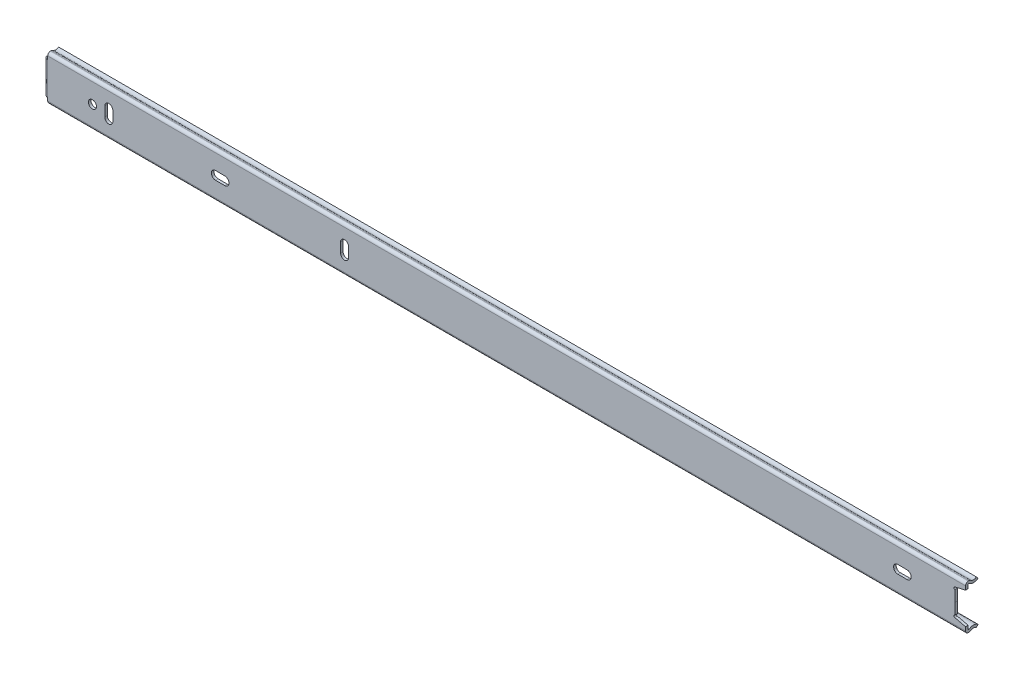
ISO-10303-21;
HEADER;
FILE_DESCRIPTION(('STEP AP214'),'2;1');
FILE_NAME('part.step','',(''),(''),'','','');
FILE_SCHEMA(('AUTOMOTIVE_DESIGN { 1 0 10303 214 1 1 1 1 }'));
ENDSEC;
DATA;
#1=APPLICATION_CONTEXT('core data for automotive mechanical design processes');
#2=APPLICATION_PROTOCOL_DEFINITION('international standard','automotive_design',2000,#1);
#3=PRODUCT_CONTEXT('',#1,'mechanical');
#4=PRODUCT('Part','Part','',(#3));
#5=PRODUCT_RELATED_PRODUCT_CATEGORY('part','',(#4));
#6=PRODUCT_DEFINITION_FORMATION('','',#4);
#7=PRODUCT_DEFINITION_CONTEXT('part definition',#1,'design');
#8=PRODUCT_DEFINITION('design','',#6,#7);
#9=PRODUCT_DEFINITION_SHAPE('','',#8);
#10=(LENGTH_UNIT() NAMED_UNIT(*) SI_UNIT(.MILLI.,.METRE.));
#11=(NAMED_UNIT(*) PLANE_ANGLE_UNIT() SI_UNIT($,.RADIAN.));
#12=(NAMED_UNIT(*) SI_UNIT($,.STERADIAN.) SOLID_ANGLE_UNIT());
#13=UNCERTAINTY_MEASURE_WITH_UNIT(LENGTH_MEASURE(1.E-05),#10,'distance_accuracy_value','');
#14=(GEOMETRIC_REPRESENTATION_CONTEXT(3) GLOBAL_UNCERTAINTY_ASSIGNED_CONTEXT((#13)) GLOBAL_UNIT_ASSIGNED_CONTEXT((#10,
#11,#12)) REPRESENTATION_CONTEXT('',''));
#15=CARTESIAN_POINT('',(0.,0.,0.));
#16=DIRECTION('',(0.,0.,1.));
#17=DIRECTION('',(1.,0.,0.));
#18=AXIS2_PLACEMENT_3D('',#15,#16,#17);
#19=CARTESIAN_POINT('',(-257.937,0.,7.0612));
#20=DIRECTION('',(0.,0.,-1.));
#21=DIRECTION('',(-1.,0.,0.));
#22=AXIS2_PLACEMENT_3D('',#19,#20,#21);
#23=PLANE('',#22);
#24=DIRECTION('',(1.,0.,0.));
#25=VECTOR('',#24,1.);
#26=CARTESIAN_POINT('',(-758.063,8.89,7.06119999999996));
#27=LINE('',#26,#25);
#28=CARTESIAN_POINT('',(-756.412,8.89,7.06119999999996));
#29=VERTEX_POINT('',#28);
#30=CARTESIAN_POINT('',(-756.158,8.89,7.0612));
#31=VERTEX_POINT('',#30);
#32=EDGE_CURVE('E516',#29,#31,#27,.T.);
#33=ORIENTED_EDGE('',*,*,#32,.F.);
#34=DIRECTION('',(0.,1.,0.));
#35=VECTOR('',#34,1.);
#36=CARTESIAN_POINT('',(-756.412,0.,7.0612));
#37=LINE('',#36,#35);
#38=CARTESIAN_POINT('',(-756.412,-8.89,7.06119999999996));
#39=VERTEX_POINT('',#38);
#40=EDGE_CURVE('E53',#29,#39,#37,.F.);
#41=ORIENTED_EDGE('',*,*,#40,.T.);
#42=DIRECTION('',(1.,0.,0.));
#43=VECTOR('',#42,1.);
#44=CARTESIAN_POINT('',(-758.063,-8.89,7.06119999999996));
#45=LINE('',#44,#43);
#46=CARTESIAN_POINT('',(-756.158,-8.89,7.06119999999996));
#47=VERTEX_POINT('',#46);
#48=EDGE_CURVE('E513',#39,#47,#45,.T.);
#49=ORIENTED_EDGE('',*,*,#48,.T.);
#50=DIRECTION('',(0.,1.,0.));
#51=VECTOR('',#50,1.);
#52=CARTESIAN_POINT('',(-756.158,0.,7.0612));
#53=LINE('',#52,#51);
#54=CARTESIAN_POINT('',(-756.158,-10.623486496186,7.0612));
#55=VERTEX_POINT('',#54);
#56=EDGE_CURVE('E1142',#55,#47,#53,.T.);
#57=ORIENTED_EDGE('',*,*,#56,.F.);
#58=DIRECTION('',(-1.,0.,0.));
#59=VECTOR('',#58,1.);
#60=CARTESIAN_POINT('',(-257.937,-10.623486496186,7.0612));
#61=LINE('',#60,#59);
#62=CARTESIAN_POINT('',(-257.937,-10.623486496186,7.0612));
#63=VERTEX_POINT('',#62);
#64=EDGE_CURVE('E1381',#55,#63,#61,.F.);
#65=ORIENTED_EDGE('',*,*,#64,.T.);
#66=DIRECTION('',(0.,1.,0.));
#67=VECTOR('',#66,1.);
#68=CARTESIAN_POINT('',(-257.937,0.,7.0612));
#69=LINE('',#68,#67);
#70=CARTESIAN_POINT('',(-257.937,-8.58928584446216,7.0612));
#71=VERTEX_POINT('',#70);
#72=EDGE_CURVE('E536',#71,#63,#69,.F.);
#73=ORIENTED_EDGE('',*,*,#72,.F.);
#74=DIRECTION('',(0.973808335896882,-0.227370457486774,0.));
#75=VECTOR('',#74,1.);
#76=CARTESIAN_POINT('',(-263.796326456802,-7.22121608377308,7.0612));
#77=LINE('',#76,#75);
#78=CARTESIAN_POINT('',(-263.796326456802,-7.22121608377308,7.0612));
#79=VERTEX_POINT('',#78);
#80=EDGE_CURVE('E623',#79,#71,#77,.T.);
#81=ORIENTED_EDGE('',*,*,#80,.F.);
#82=CARTESIAN_POINT('',(-263.651946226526,-6.60284783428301,7.0612));
#83=DIRECTION('',(0.,0.,1.));
#84=DIRECTION('',(1.,0.,0.));
#85=AXIS2_PLACEMENT_3D('',#82,#83,#84);
#86=CIRCLE('',#85,0.634999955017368);
#87=CARTESIAN_POINT('',(-263.651951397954,-5.9678478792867,7.0612));
#88=VERTEX_POINT('',#87);
#89=EDGE_CURVE('E627',#88,#79,#86,.T.);
#90=ORIENTED_EDGE('',*,*,#89,.F.);
#91=DIRECTION('',(8.14398201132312E-06,-0.999999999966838,0.));
#92=VECTOR('',#91,1.);
#93=CARTESIAN_POINT('',(-263.652,0.,7.0612));
#94=LINE('',#93,#92);
#95=CARTESIAN_POINT('',(-263.652,1.63414691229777E-06,7.0612));
#96=VERTEX_POINT('',#95);
#97=EDGE_CURVE('E630',#96,#88,#94,.T.);
#98=ORIENTED_EDGE('',*,*,#97,.F.);
#99=DIRECTION('',(-8.14398201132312E-06,-0.999999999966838,0.));
#100=VECTOR('',#99,1.);
#101=CARTESIAN_POINT('',(-263.651951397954,5.9678478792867,7.0612));
#102=LINE('',#101,#100);
#103=CARTESIAN_POINT('',(-263.651951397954,5.9678478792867,7.0612));
#104=VERTEX_POINT('',#103);
#105=EDGE_CURVE('E797',#104,#96,#102,.T.);
#106=ORIENTED_EDGE('',*,*,#105,.F.);
#107=CARTESIAN_POINT('',(-263.651946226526,6.60284783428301,7.0612));
#108=DIRECTION('',(0.,0.,1.));
#109=DIRECTION('',(1.,0.,0.));
#110=AXIS2_PLACEMENT_3D('',#107,#108,#109);
#111=CIRCLE('',#110,0.634999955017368);
#112=CARTESIAN_POINT('',(-263.796326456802,7.22121608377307,7.0612));
#113=VERTEX_POINT('',#112);
#114=EDGE_CURVE('E649',#113,#104,#111,.T.);
#115=ORIENTED_EDGE('',*,*,#114,.F.);
#116=DIRECTION('',(-0.973808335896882,-0.227370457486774,0.));
#117=VECTOR('',#116,1.);
#118=CARTESIAN_POINT('',(-257.937,8.58928584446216,7.0612));
#119=LINE('',#118,#117);
#120=CARTESIAN_POINT('',(-257.937,8.58928584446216,7.0612));
#121=VERTEX_POINT('',#120);
#122=EDGE_CURVE('E798',#121,#113,#119,.T.);
#123=ORIENTED_EDGE('',*,*,#122,.F.);
#124=DIRECTION('',(0.,1.,0.));
#125=VECTOR('',#124,1.);
#126=CARTESIAN_POINT('',(-257.937,0.,7.0612));
#127=LINE('',#126,#125);
#128=CARTESIAN_POINT('',(-257.937,10.623486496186,7.0612));
#129=VERTEX_POINT('',#128);
#130=EDGE_CURVE('E1138',#129,#121,#127,.F.);
#131=ORIENTED_EDGE('',*,*,#130,.F.);
#132=DIRECTION('',(1.,0.,0.));
#133=VECTOR('',#132,1.);
#134=CARTESIAN_POINT('',(-257.937,10.623486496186,7.0612));
#135=LINE('',#134,#133);
#136=CARTESIAN_POINT('',(-756.158,10.623486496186,7.0612));
#137=VERTEX_POINT('',#136);
#138=EDGE_CURVE('E1379',#129,#137,#135,.F.);
#139=ORIENTED_EDGE('',*,*,#138,.T.);
#140=EDGE_CURVE('E505',#31,#137,#53,.T.);
#141=ORIENTED_EDGE('',*,*,#140,.F.);
#142=EDGE_LOOP('',(#33,#41,#49,#57,#65,#73,#81,#90,#98,#106,#115,#123,#131,#139,#141));
#143=FACE_BOUND('',#142,.T.);
#144=DIRECTION('',(1.,0.,0.));
#145=VECTOR('',#144,1.);
#146=CARTESIAN_POINT('',(-257.937,2.28599999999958,7.0612));
#147=LINE('',#146,#145);
#148=CARTESIAN_POINT('',(-665.0355,2.286,7.0612));
#149=VERTEX_POINT('',#148);
#150=CARTESIAN_POINT('',(-660.0825,2.286,7.0612));
#151=VERTEX_POINT('',#150);
#152=EDGE_CURVE('E539',#149,#151,#147,.T.);
#153=ORIENTED_EDGE('',*,*,#152,.T.);
#154=CARTESIAN_POINT('',(-660.0825,0.,7.0612));
#155=DIRECTION('',(0.,0.,-1.));
#156=DIRECTION('',(-1.,0.,0.));
#157=AXIS2_PLACEMENT_3D('',#154,#155,#156);
#158=CIRCLE('',#157,2.286);
#159=CARTESIAN_POINT('',(-660.0825,-2.286,7.0612));
#160=VERTEX_POINT('',#159);
#161=EDGE_CURVE('E542',#151,#160,#158,.T.);
#162=ORIENTED_EDGE('',*,*,#161,.T.);
#163=DIRECTION('',(-1.,0.,0.));
#164=VECTOR('',#163,1.);
#165=CARTESIAN_POINT('',(-257.937,-2.28600000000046,7.0612));
#166=LINE('',#165,#164);
#167=CARTESIAN_POINT('',(-665.0355,-2.286,7.0612));
#168=VERTEX_POINT('',#167);
#169=EDGE_CURVE('E532',#160,#168,#166,.T.);
#170=ORIENTED_EDGE('',*,*,#169,.T.);
#171=CARTESIAN_POINT('',(-665.0355,0.,7.0612));
#172=DIRECTION('',(0.,0.,-1.));
#173=DIRECTION('',(-1.,0.,0.));
#174=AXIS2_PLACEMENT_3D('',#171,#172,#173);
#175=CIRCLE('',#174,2.286);
#176=EDGE_CURVE('E535',#168,#149,#175,.T.);
#177=ORIENTED_EDGE('',*,*,#176,.T.);
#178=EDGE_LOOP('',(#153,#162,#170,#177));
#179=FACE_BOUND('',#178,.T.);
#180=DIRECTION('',(0.,1.,0.));
#181=VECTOR('',#180,1.);
#182=CARTESIAN_POINT('',(-725.1954,0.,7.0612));
#183=LINE('',#182,#181);
#184=CARTESIAN_POINT('',(-725.1954,-2.6416,7.0612));
#185=VERTEX_POINT('',#184);
#186=CARTESIAN_POINT('',(-725.1954,2.6416,7.0612));
#187=VERTEX_POINT('',#186);
#188=EDGE_CURVE('E551',#185,#187,#183,.T.);
#189=ORIENTED_EDGE('',*,*,#188,.T.);
#190=CARTESIAN_POINT('',(-723.011,2.6416,7.0612));
#191=DIRECTION('',(0.,0.,-1.));
#192=DIRECTION('',(-1.,0.,0.));
#193=AXIS2_PLACEMENT_3D('',#190,#191,#192);
#194=CIRCLE('',#193,2.18440000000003);
#195=CARTESIAN_POINT('',(-720.8266,2.64159999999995,7.0612));
#196=VERTEX_POINT('',#195);
#197=EDGE_CURVE('E554',#187,#196,#194,.T.);
#198=ORIENTED_EDGE('',*,*,#197,.T.);
#199=DIRECTION('',(0.,-1.,0.));
#200=VECTOR('',#199,1.);
#201=CARTESIAN_POINT('',(-720.8266,1.94545234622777E-11,7.0612));
#202=LINE('',#201,#200);
#203=CARTESIAN_POINT('',(-720.8266,-2.64160000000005,7.0612));
#204=VERTEX_POINT('',#203);
#205=EDGE_CURVE('E545',#196,#204,#202,.T.);
#206=ORIENTED_EDGE('',*,*,#205,.T.);
#207=CARTESIAN_POINT('',(-723.011,-2.6416,7.0612));
#208=DIRECTION('',(0.,0.,-1.));
#209=DIRECTION('',(-1.,0.,0.));
#210=AXIS2_PLACEMENT_3D('',#207,#208,#209);
#211=CIRCLE('',#210,2.18439999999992);
#212=EDGE_CURVE('E548',#204,#185,#211,.T.);
#213=ORIENTED_EDGE('',*,*,#212,.T.);
#214=EDGE_LOOP('',(#189,#198,#206,#213));
#215=FACE_BOUND('',#214,.T.);
#216=DIRECTION('',(1.,0.,0.));
#217=VECTOR('',#216,1.);
#218=CARTESIAN_POINT('',(-257.937,2.286,7.0612));
#219=LINE('',#218,#217);
#220=CARTESIAN_POINT('',(-294.7035,2.286,7.0612));
#221=VERTEX_POINT('',#220);
#222=CARTESIAN_POINT('',(-289.7505,2.286,7.0612));
#223=VERTEX_POINT('',#222);
#224=EDGE_CURVE('E563',#221,#223,#219,.T.);
#225=ORIENTED_EDGE('',*,*,#224,.T.);
#226=CARTESIAN_POINT('',(-289.7505,0.,7.0612));
#227=DIRECTION('',(0.,0.,-1.));
#228=DIRECTION('',(-1.,0.,0.));
#229=AXIS2_PLACEMENT_3D('',#226,#227,#228);
#230=CIRCLE('',#229,2.28600000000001);
#231=CARTESIAN_POINT('',(-289.7505,-2.28600000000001,7.0612));
#232=VERTEX_POINT('',#231);
#233=EDGE_CURVE('E566',#223,#232,#230,.T.);
#234=ORIENTED_EDGE('',*,*,#233,.T.);
#235=DIRECTION('',(-1.,0.,0.));
#236=VECTOR('',#235,1.);
#237=CARTESIAN_POINT('',(-257.937,-2.28600000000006,7.0612));
#238=LINE('',#237,#236);
#239=CARTESIAN_POINT('',(-294.7035,-2.286,7.0612));
#240=VERTEX_POINT('',#239);
#241=EDGE_CURVE('E557',#232,#240,#238,.T.);
#242=ORIENTED_EDGE('',*,*,#241,.T.);
#243=CARTESIAN_POINT('',(-294.7035,0.,7.0612));
#244=DIRECTION('',(0.,0.,-1.));
#245=DIRECTION('',(-1.,0.,0.));
#246=AXIS2_PLACEMENT_3D('',#243,#244,#245);
#247=CIRCLE('',#246,2.286);
#248=EDGE_CURVE('E560',#240,#221,#247,.T.);
#249=ORIENTED_EDGE('',*,*,#248,.T.);
#250=EDGE_LOOP('',(#225,#234,#242,#249));
#251=FACE_BOUND('',#250,.T.);
#252=DIRECTION('',(0.,1.,0.));
#253=VECTOR('',#252,1.);
#254=CARTESIAN_POINT('',(-592.8266,-2.6416,7.0612));
#255=LINE('',#254,#253);
#256=CARTESIAN_POINT('',(-592.8266,-2.6416,7.0612));
#257=VERTEX_POINT('',#256);
#258=CARTESIAN_POINT('',(-592.8266,2.6416,7.0612));
#259=VERTEX_POINT('',#258);
#260=EDGE_CURVE('E383',#257,#259,#255,.T.);
#261=ORIENTED_EDGE('',*,*,#260,.F.);
#262=CARTESIAN_POINT('',(-595.011,-2.6416,7.0612));
#263=DIRECTION('',(0.,0.,1.));
#264=DIRECTION('',(1.,0.,0.));
#265=AXIS2_PLACEMENT_3D('',#262,#263,#264);
#266=CIRCLE('',#265,2.18439999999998);
#267=CARTESIAN_POINT('',(-597.1954,-2.6416,7.0612));
#268=VERTEX_POINT('',#267);
#269=EDGE_CURVE('E388',#268,#257,#266,.T.);
#270=ORIENTED_EDGE('',*,*,#269,.F.);
#271=DIRECTION('',(0.,-1.,0.));
#272=VECTOR('',#271,1.);
#273=CARTESIAN_POINT('',(-597.1954,2.6416,7.0612));
#274=LINE('',#273,#272);
#275=CARTESIAN_POINT('',(-597.1954,2.6416,7.0612));
#276=VERTEX_POINT('',#275);
#277=EDGE_CURVE('E392',#276,#268,#274,.T.);
#278=ORIENTED_EDGE('',*,*,#277,.F.);
#279=CARTESIAN_POINT('',(-595.011,2.6416,7.0612));
#280=DIRECTION('',(0.,0.,1.));
#281=DIRECTION('',(1.,0.,0.));
#282=AXIS2_PLACEMENT_3D('',#279,#280,#281);
#283=CIRCLE('',#282,2.18439999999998);
#284=EDGE_CURVE('E371',#259,#276,#283,.T.);
#285=ORIENTED_EDGE('',*,*,#284,.F.);
#286=EDGE_LOOP('',(#261,#270,#278,#285));
#287=FACE_BOUND('',#286,.T.);
#288=CARTESIAN_POINT('',(-731.901,0.,7.0612));
#289=DIRECTION('',(0.,0.,1.));
#290=DIRECTION('',(1.,0.,0.));
#291=AXIS2_PLACEMENT_3D('',#288,#289,#290);
#292=CIRCLE('',#291,2.18439999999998);
#293=CARTESIAN_POINT('',(-729.7166,0.,7.0612));
#294=VERTEX_POINT('',#293);
#295=EDGE_CURVE('E1088',#294,#294,#292,.T.);
#296=ORIENTED_EDGE('',*,*,#295,.F.);
#297=EDGE_LOOP('',(#296));
#298=FACE_BOUND('',#297,.T.);
#299=ADVANCED_FACE('F45',(#143,#179,#215,#251,#287,#298),#23,.F.);
#300=CARTESIAN_POINT('',(-263.651946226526,6.60284783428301,5.6642));
#301=DIRECTION('',(0.,0.,1.));
#302=DIRECTION('',(1.,0.,0.));
#303=AXIS2_PLACEMENT_3D('',#300,#301,#302);
#304=PLANE('',#303);
#305=CARTESIAN_POINT('',(-731.901,0.,5.6642));
#306=DIRECTION('',(0.,0.,1.));
#307=DIRECTION('',(1.,0.,0.));
#308=AXIS2_PLACEMENT_3D('',#305,#306,#307);
#309=CIRCLE('',#308,2.18439999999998);
#310=CARTESIAN_POINT('',(-729.7166,0.,5.6642));
#311=VERTEX_POINT('',#310);
#312=EDGE_CURVE('E1091',#311,#311,#309,.T.);
#313=ORIENTED_EDGE('',*,*,#312,.T.);
#314=EDGE_LOOP('',(#313));
#315=FACE_BOUND('',#314,.T.);
#316=DIRECTION('',(0.,-1.,0.));
#317=VECTOR('',#316,1.);
#318=CARTESIAN_POINT('',(-597.1954,6.60284783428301,5.6642));
#319=LINE('',#318,#317);
#320=CARTESIAN_POINT('',(-597.1954,2.6416,5.6642));
#321=VERTEX_POINT('',#320);
#322=CARTESIAN_POINT('',(-597.1954,-2.6416,5.6642));
#323=VERTEX_POINT('',#322);
#324=EDGE_CURVE('E405',#321,#323,#319,.T.);
#325=ORIENTED_EDGE('',*,*,#324,.T.);
#326=CARTESIAN_POINT('',(-595.011,-2.6416,5.6642));
#327=DIRECTION('',(0.,0.,1.));
#328=DIRECTION('',(1.,0.,0.));
#329=AXIS2_PLACEMENT_3D('',#326,#327,#328);
#330=CIRCLE('',#329,2.18439999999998);
#331=CARTESIAN_POINT('',(-592.8266,-2.6416,5.6642));
#332=VERTEX_POINT('',#331);
#333=EDGE_CURVE('E408',#323,#332,#330,.T.);
#334=ORIENTED_EDGE('',*,*,#333,.T.);
#335=DIRECTION('',(0.,1.,0.));
#336=VECTOR('',#335,1.);
#337=CARTESIAN_POINT('',(-592.8266,6.60284783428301,5.6642));
#338=LINE('',#337,#336);
#339=CARTESIAN_POINT('',(-592.8266,2.6416,5.6642));
#340=VERTEX_POINT('',#339);
#341=EDGE_CURVE('E399',#332,#340,#338,.T.);
#342=ORIENTED_EDGE('',*,*,#341,.T.);
#343=CARTESIAN_POINT('',(-595.011,2.6416,5.6642));
#344=DIRECTION('',(0.,0.,1.));
#345=DIRECTION('',(1.,0.,0.));
#346=AXIS2_PLACEMENT_3D('',#343,#344,#345);
#347=CIRCLE('',#346,2.18439999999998);
#348=EDGE_CURVE('E374',#340,#321,#347,.T.);
#349=ORIENTED_EDGE('',*,*,#348,.T.);
#350=EDGE_LOOP('',(#325,#334,#342,#349));
#351=FACE_BOUND('',#350,.T.);
#352=DIRECTION('',(-1.,0.,0.));
#353=VECTOR('',#352,1.);
#354=CARTESIAN_POINT('',(-289.7505,-2.28600000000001,5.6642));
#355=LINE('',#354,#353);
#356=CARTESIAN_POINT('',(-289.7505,-2.28600000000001,5.6642));
#357=VERTEX_POINT('',#356);
#358=CARTESIAN_POINT('',(-294.7035,-2.28600000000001,5.6642));
#359=VERTEX_POINT('',#358);
#360=EDGE_CURVE('E414',#357,#359,#355,.T.);
#361=ORIENTED_EDGE('',*,*,#360,.F.);
#362=CARTESIAN_POINT('',(-289.7505,0.,5.6642));
#363=DIRECTION('',(0.,0.,-1.));
#364=DIRECTION('',(-1.,0.,0.));
#365=AXIS2_PLACEMENT_3D('',#362,#363,#364);
#366=CIRCLE('',#365,2.28600000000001);
#367=CARTESIAN_POINT('',(-289.7505,2.286,5.6642));
#368=VERTEX_POINT('',#367);
#369=EDGE_CURVE('E412',#368,#357,#366,.T.);
#370=ORIENTED_EDGE('',*,*,#369,.F.);
#371=DIRECTION('',(1.,0.,0.));
#372=VECTOR('',#371,1.);
#373=CARTESIAN_POINT('',(-294.7035,2.286,5.6642));
#374=LINE('',#373,#372);
#375=CARTESIAN_POINT('',(-294.7035,2.286,5.6642));
#376=VERTEX_POINT('',#375);
#377=EDGE_CURVE('E420',#376,#368,#374,.T.);
#378=ORIENTED_EDGE('',*,*,#377,.F.);
#379=CARTESIAN_POINT('',(-294.7035,0.,5.6642));
#380=DIRECTION('',(0.,0.,-1.));
#381=DIRECTION('',(-1.,0.,0.));
#382=AXIS2_PLACEMENT_3D('',#379,#380,#381);
#383=CIRCLE('',#382,2.286);
#384=EDGE_CURVE('E417',#359,#376,#383,.T.);
#385=ORIENTED_EDGE('',*,*,#384,.F.);
#386=EDGE_LOOP('',(#361,#370,#378,#385));
#387=FACE_BOUND('',#386,.T.);
#388=DIRECTION('',(0.,-1.,0.));
#389=VECTOR('',#388,1.);
#390=CARTESIAN_POINT('',(-720.8266,2.64159999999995,5.6642));
#391=LINE('',#390,#389);
#392=CARTESIAN_POINT('',(-720.8266,2.64159999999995,5.6642));
#393=VERTEX_POINT('',#392);
#394=CARTESIAN_POINT('',(-720.8266,-2.64160000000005,5.6642));
#395=VERTEX_POINT('',#394);
#396=EDGE_CURVE('E434',#393,#395,#391,.T.);
#397=ORIENTED_EDGE('',*,*,#396,.F.);
#398=CARTESIAN_POINT('',(-723.011,2.6416,5.6642));
#399=DIRECTION('',(0.,0.,-1.));
#400=DIRECTION('',(-1.,0.,0.));
#401=AXIS2_PLACEMENT_3D('',#398,#399,#400);
#402=CIRCLE('',#401,2.18440000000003);
#403=CARTESIAN_POINT('',(-725.1954,2.6416,5.6642));
#404=VERTEX_POINT('',#403);
#405=EDGE_CURVE('E426',#404,#393,#402,.T.);
#406=ORIENTED_EDGE('',*,*,#405,.F.);
#407=DIRECTION('',(0.,1.,0.));
#408=VECTOR('',#407,1.);
#409=CARTESIAN_POINT('',(-725.1954,-2.6416,5.6642));
#410=LINE('',#409,#408);
#411=CARTESIAN_POINT('',(-725.1954,-2.6416,5.6642));
#412=VERTEX_POINT('',#411);
#413=EDGE_CURVE('E440',#412,#404,#410,.T.);
#414=ORIENTED_EDGE('',*,*,#413,.F.);
#415=CARTESIAN_POINT('',(-723.011,-2.6416,5.6642));
#416=DIRECTION('',(0.,0.,-1.));
#417=DIRECTION('',(-1.,0.,0.));
#418=AXIS2_PLACEMENT_3D('',#415,#416,#417);
#419=CIRCLE('',#418,2.18439999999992);
#420=EDGE_CURVE('E437',#395,#412,#419,.T.);
#421=ORIENTED_EDGE('',*,*,#420,.F.);
#422=EDGE_LOOP('',(#397,#406,#414,#421));
#423=FACE_BOUND('',#422,.T.);
#424=DIRECTION('',(-1.,0.,0.));
#425=VECTOR('',#424,1.);
#426=CARTESIAN_POINT('',(-660.0825,-2.286,5.6642));
#427=LINE('',#426,#425);
#428=CARTESIAN_POINT('',(-660.0825,-2.28600000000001,5.6642));
#429=VERTEX_POINT('',#428);
#430=CARTESIAN_POINT('',(-665.0355,-2.286,5.6642));
#431=VERTEX_POINT('',#430);
#432=EDGE_CURVE('E454',#429,#431,#427,.T.);
#433=ORIENTED_EDGE('',*,*,#432,.F.);
#434=CARTESIAN_POINT('',(-660.0825,0.,5.6642));
#435=DIRECTION('',(0.,0.,-1.));
#436=DIRECTION('',(-1.,0.,0.));
#437=AXIS2_PLACEMENT_3D('',#434,#435,#436);
#438=CIRCLE('',#437,2.286);
#439=CARTESIAN_POINT('',(-660.0825,2.286,5.6642));
#440=VERTEX_POINT('',#439);
#441=EDGE_CURVE('E446',#440,#429,#438,.T.);
#442=ORIENTED_EDGE('',*,*,#441,.F.);
#443=DIRECTION('',(1.,0.,0.));
#444=VECTOR('',#443,1.);
#445=CARTESIAN_POINT('',(-665.0355,2.286,5.6642));
#446=LINE('',#445,#444);
#447=CARTESIAN_POINT('',(-665.0355,2.286,5.6642));
#448=VERTEX_POINT('',#447);
#449=EDGE_CURVE('E460',#448,#440,#446,.T.);
#450=ORIENTED_EDGE('',*,*,#449,.F.);
#451=CARTESIAN_POINT('',(-665.0355,0.,5.6642));
#452=DIRECTION('',(0.,0.,-1.));
#453=DIRECTION('',(-1.,0.,0.));
#454=AXIS2_PLACEMENT_3D('',#451,#452,#453);
#455=CIRCLE('',#454,2.286);
#456=EDGE_CURVE('E457',#431,#448,#455,.T.);
#457=ORIENTED_EDGE('',*,*,#456,.F.);
#458=EDGE_LOOP('',(#433,#442,#450,#457));
#459=FACE_BOUND('',#458,.T.);
#460=DIRECTION('',(1.,0.,0.));
#461=VECTOR('',#460,1.);
#462=CARTESIAN_POINT('',(-758.063,-8.89,5.66419999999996));
#463=LINE('',#462,#461);
#464=CARTESIAN_POINT('',(-756.412,-8.89,5.66419999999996));
#465=VERTEX_POINT('',#464);
#466=CARTESIAN_POINT('',(-756.158,-8.89,5.6642));
#467=VERTEX_POINT('',#466);
#468=EDGE_CURVE('E515',#465,#467,#463,.T.);
#469=ORIENTED_EDGE('',*,*,#468,.F.);
#470=DIRECTION('',(0.,-1.,0.));
#471=VECTOR('',#470,1.);
#472=CARTESIAN_POINT('',(-756.412,8.89,5.6642));
#473=LINE('',#472,#471);
#474=CARTESIAN_POINT('',(-756.412,8.89,5.66419999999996));
#475=VERTEX_POINT('',#474);
#476=EDGE_CURVE('E1112',#465,#475,#473,.F.);
#477=ORIENTED_EDGE('',*,*,#476,.T.);
#478=DIRECTION('',(1.,0.,0.));
#479=VECTOR('',#478,1.);
#480=CARTESIAN_POINT('',(-758.063,8.89,5.66419999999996));
#481=LINE('',#480,#479);
#482=CARTESIAN_POINT('',(-756.158,8.89,5.6642));
#483=VERTEX_POINT('',#482);
#484=EDGE_CURVE('E496',#475,#483,#481,.T.);
#485=ORIENTED_EDGE('',*,*,#484,.T.);
#486=DIRECTION('',(0.,1.,0.));
#487=VECTOR('',#486,1.);
#488=CARTESIAN_POINT('',(-756.158,-10.7504864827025,5.6642));
#489=LINE('',#488,#487);
#490=CARTESIAN_POINT('',(-756.158,10.623486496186,5.6642));
#491=VERTEX_POINT('',#490);
#492=EDGE_CURVE('E591',#483,#491,#489,.T.);
#493=ORIENTED_EDGE('',*,*,#492,.T.);
#494=DIRECTION('',(1.,0.,0.));
#495=VECTOR('',#494,1.);
#496=CARTESIAN_POINT('',(-257.937,10.623486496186,5.6642));
#497=LINE('',#496,#495);
#498=CARTESIAN_POINT('',(-257.937,10.623486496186,5.6642));
#499=VERTEX_POINT('',#498);
#500=EDGE_CURVE('E1893',#491,#499,#497,.T.);
#501=ORIENTED_EDGE('',*,*,#500,.T.);
#502=DIRECTION('',(0.,-1.,0.));
#503=VECTOR('',#502,1.);
#504=CARTESIAN_POINT('',(-257.937,10.7504864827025,5.6642));
#505=LINE('',#504,#503);
#506=CARTESIAN_POINT('',(-257.937,8.58928584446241,5.6642));
#507=VERTEX_POINT('',#506);
#508=EDGE_CURVE('E570',#499,#507,#505,.T.);
#509=ORIENTED_EDGE('',*,*,#508,.T.);
#510=DIRECTION('',(-0.973808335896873,-0.227370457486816,0.));
#511=VECTOR('',#510,1.);
#512=CARTESIAN_POINT('',(-257.937,8.58928584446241,5.6642));
#513=LINE('',#512,#511);
#514=CARTESIAN_POINT('',(-263.796326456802,7.22121608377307,5.6642));
#515=VERTEX_POINT('',#514);
#516=EDGE_CURVE('E573',#507,#515,#513,.T.);
#517=ORIENTED_EDGE('',*,*,#516,.T.);
#518=CARTESIAN_POINT('',(-263.651946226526,6.60284783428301,5.6642));
#519=DIRECTION('',(0.,0.,1.));
#520=DIRECTION('',(1.,0.,0.));
#521=AXIS2_PLACEMENT_3D('',#518,#519,#520);
#522=CIRCLE('',#521,0.634999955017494);
#523=CARTESIAN_POINT('',(-263.651946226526,5.96784787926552,5.6642));
#524=VERTEX_POINT('',#523);
#525=EDGE_CURVE('E595',#515,#524,#522,.T.);
#526=ORIENTED_EDGE('',*,*,#525,.T.);
#527=DIRECTION('',(8.14398201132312E-06,0.999999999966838,0.));
#528=VECTOR('',#527,1.);
#529=CARTESIAN_POINT('',(-263.651951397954,5.9678478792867,5.6642));
#530=LINE('',#529,#528);
#531=CARTESIAN_POINT('',(-263.652,0.,5.6642));
#532=VERTEX_POINT('',#531);
#533=EDGE_CURVE('E614',#532,#524,#530,.T.);
#534=ORIENTED_EDGE('',*,*,#533,.F.);
#535=DIRECTION('',(-8.14398201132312E-06,0.999999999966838,0.));
#536=VECTOR('',#535,1.);
#537=CARTESIAN_POINT('',(-263.651951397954,-5.9678478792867,5.6642));
#538=LINE('',#537,#536);
#539=CARTESIAN_POINT('',(-263.651946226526,-5.96784787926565,5.6642));
#540=VERTEX_POINT('',#539);
#541=EDGE_CURVE('E602',#540,#532,#538,.T.);
#542=ORIENTED_EDGE('',*,*,#541,.F.);
#543=CARTESIAN_POINT('',(-263.651946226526,-6.60284783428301,5.6642));
#544=DIRECTION('',(0.,0.,1.));
#545=DIRECTION('',(1.,0.,0.));
#546=AXIS2_PLACEMENT_3D('',#543,#544,#545);
#547=CIRCLE('',#546,0.634999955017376);
#548=CARTESIAN_POINT('',(-263.796326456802,-7.22121608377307,5.6642));
#549=VERTEX_POINT('',#548);
#550=EDGE_CURVE('E584',#540,#549,#547,.T.);
#551=ORIENTED_EDGE('',*,*,#550,.T.);
#552=DIRECTION('',(0.973808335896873,-0.227370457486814,0.));
#553=VECTOR('',#552,1.);
#554=CARTESIAN_POINT('',(-263.796326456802,-7.22121608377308,5.6642));
#555=LINE('',#554,#553);
#556=CARTESIAN_POINT('',(-257.937,-8.5892858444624,5.6642));
#557=VERTEX_POINT('',#556);
#558=EDGE_CURVE('E581',#549,#557,#555,.T.);
#559=ORIENTED_EDGE('',*,*,#558,.T.);
#560=DIRECTION('',(0.,-1.,0.));
#561=VECTOR('',#560,1.);
#562=CARTESIAN_POINT('',(-257.937,-8.5892858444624,5.6642));
#563=LINE('',#562,#561);
#564=CARTESIAN_POINT('',(-257.937,-10.623486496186,5.6642));
#565=VERTEX_POINT('',#564);
#566=EDGE_CURVE('E583',#557,#565,#563,.T.);
#567=ORIENTED_EDGE('',*,*,#566,.T.);
#568=DIRECTION('',(-1.,0.,0.));
#569=VECTOR('',#568,1.);
#570=CARTESIAN_POINT('',(-756.158,-10.623486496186,5.6642));
#571=LINE('',#570,#569);
#572=CARTESIAN_POINT('',(-756.158,-10.623486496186,5.6642));
#573=VERTEX_POINT('',#572);
#574=EDGE_CURVE('E569',#565,#573,#571,.T.);
#575=ORIENTED_EDGE('',*,*,#574,.T.);
#576=EDGE_CURVE('E574',#573,#467,#489,.T.);
#577=ORIENTED_EDGE('',*,*,#576,.T.);
#578=EDGE_LOOP('',(#469,#477,#485,#493,#501,#509,#517,#526,#534,#542,#551,#559,#567,#575,#577));
#579=FACE_BOUND('',#578,.T.);
#580=ADVANCED_FACE('F988',(#315,#351,#387,#423,#459,#579),#304,.F.);
#581=CARTESIAN_POINT('',(-756.158,0.,-5.6388));
#582=DIRECTION('',(1.,0.,0.));
#583=DIRECTION('',(0.,0.,-1.));
#584=AXIS2_PLACEMENT_3D('',#581,#582,#583);
#585=PLANE('',#584);
#586=ORIENTED_EDGE('',*,*,#140,.T.);
#587=CARTESIAN_POINT('',(-756.158,10.623486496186,5.5372000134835));
#588=DIRECTION('',(1.,0.,0.));
#589=DIRECTION('',(0.,0.,-1.));
#590=AXIS2_PLACEMENT_3D('',#587,#588,#589);
#591=CIRCLE('',#590,1.5239999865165);
#592=CARTESIAN_POINT('',(-756.158,12.1474864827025,5.5372000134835));
#593=VERTEX_POINT('',#592);
#594=EDGE_CURVE('E1377',#137,#593,#591,.F.);
#595=ORIENTED_EDGE('',*,*,#594,.T.);
#596=DIRECTION('',(0.,0.,-1.));
#597=VECTOR('',#596,1.);
#598=CARTESIAN_POINT('',(-756.158,12.1474864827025,-5.6388));
#599=LINE('',#598,#597);
#600=CARTESIAN_POINT('',(-756.158,12.1474864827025,5.16434145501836));
#601=VERTEX_POINT('',#600);
#602=EDGE_CURVE('E684',#601,#593,#599,.F.);
#603=ORIENTED_EDGE('',*,*,#602,.F.);
#604=CARTESIAN_POINT('',(-756.158,10.623486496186,5.16434145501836));
#605=DIRECTION('',(1.,0.,0.));
#606=DIRECTION('',(0.,0.,-1.));
#607=AXIS2_PLACEMENT_3D('',#604,#605,#606);
#608=CIRCLE('',#607,1.5239999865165);
#609=CARTESIAN_POINT('',(-756.158,11.8324790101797,4.23648744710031));
#610=VERTEX_POINT('',#609);
#611=EDGE_CURVE('E1385',#601,#610,#608,.F.);
#612=ORIENTED_EDGE('',*,*,#611,.T.);
#613=CARTESIAN_POINT('',(-756.158,13.7451343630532,2.7686));
#614=DIRECTION('',(-1.,0.,0.));
#615=DIRECTION('',(0.,0.,1.));
#616=AXIS2_PLACEMENT_3D('',#613,#614,#615);
#617=CIRCLE('',#616,2.41100478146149);
#618=CARTESIAN_POINT('',(-756.158,11.9071793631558,1.2081944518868));
#619=VERTEX_POINT('',#618);
#620=EDGE_CURVE('E678',#619,#610,#617,.T.);
#621=ORIENTED_EDGE('',*,*,#620,.F.);
#622=DIRECTION('',(0.,-0.762319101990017,-0.647201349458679));
#623=VECTOR('',#622,1.);
#624=CARTESIAN_POINT('',(-756.158,10.8422195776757,0.304054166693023));
#625=LINE('',#624,#623);
#626=CARTESIAN_POINT('',(-756.158,10.8422195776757,0.304054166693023));
#627=VERTEX_POINT('',#626);
#628=EDGE_CURVE('E817',#619,#627,#625,.T.);
#629=ORIENTED_EDGE('',*,*,#628,.T.);
#630=CARTESIAN_POINT('',(-756.158,13.7451343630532,2.7686));
#631=DIRECTION('',(-1.,0.,0.));
#632=DIRECTION('',(0.,0.,1.));
#633=AXIS2_PLACEMENT_3D('',#630,#631,#632);
#634=CIRCLE('',#633,3.80800478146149);
#635=CARTESIAN_POINT('',(-756.158,10.724235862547,5.08702029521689));
#636=VERTEX_POINT('',#635);
#637=EDGE_CURVE('E685',#636,#627,#634,.F.);
#638=ORIENTED_EDGE('',*,*,#637,.F.);
#639=CARTESIAN_POINT('',(-756.158,10.623486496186,5.16434145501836));
#640=DIRECTION('',(1.,0.,0.));
#641=DIRECTION('',(0.,0.,-1.));
#642=AXIS2_PLACEMENT_3D('',#639,#640,#641);
#643=CIRCLE('',#642,0.126999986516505);
#644=CARTESIAN_POINT('',(-756.158,10.7504864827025,5.16434145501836));
#645=VERTEX_POINT('',#644);
#646=EDGE_CURVE('E1566',#636,#645,#643,.T.);
#647=ORIENTED_EDGE('',*,*,#646,.T.);
#648=DIRECTION('',(0.,0.,-1.));
#649=VECTOR('',#648,1.);
#650=CARTESIAN_POINT('',(-756.158,10.7504864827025,5.6642));
#651=LINE('',#650,#649);
#652=CARTESIAN_POINT('',(-756.158,10.7504864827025,5.53720001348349));
#653=VERTEX_POINT('',#652);
#654=EDGE_CURVE('E606',#653,#645,#651,.T.);
#655=ORIENTED_EDGE('',*,*,#654,.F.);
#656=CARTESIAN_POINT('',(-756.158,10.623486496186,5.53720001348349));
#657=DIRECTION('',(1.,0.,0.));
#658=DIRECTION('',(0.,0.,-1.));
#659=AXIS2_PLACEMENT_3D('',#656,#657,#658);
#660=CIRCLE('',#659,0.126999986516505);
#661=EDGE_CURVE('E1564',#653,#491,#660,.T.);
#662=ORIENTED_EDGE('',*,*,#661,.T.);
#663=ORIENTED_EDGE('',*,*,#492,.F.);
#664=DIRECTION('',(0.,0.,-1.));
#665=VECTOR('',#664,1.);
#666=CARTESIAN_POINT('',(-756.158,8.89,5.66419999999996));
#667=LINE('',#666,#665);
#668=EDGE_CURVE('E494',#31,#483,#667,.T.);
#669=ORIENTED_EDGE('',*,*,#668,.F.);
#670=EDGE_LOOP('',(#586,#595,#603,#612,#621,#629,#638,#647,#655,#662,#663,#669));
#671=FACE_BOUND('',#670,.T.);
#672=ADVANCED_FACE('F858',(#671),#585,.F.);
#673=DIRECTION('',(0.,0.,1.));
#674=VECTOR('',#673,1.);
#675=CARTESIAN_POINT('',(-756.158,-12.1474864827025,5.53720000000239));
#676=LINE('',#675,#674);
#677=CARTESIAN_POINT('',(-756.158,-12.1474864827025,5.16434145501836));
#678=VERTEX_POINT('',#677);
#679=CARTESIAN_POINT('',(-756.158,-12.1474864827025,5.5372000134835));
#680=VERTEX_POINT('',#679);
#681=EDGE_CURVE('E763',#678,#680,#676,.T.);
#682=ORIENTED_EDGE('',*,*,#681,.T.);
#683=CARTESIAN_POINT('',(-756.158,-10.623486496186,5.5372000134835));
#684=DIRECTION('',(1.,0.,0.));
#685=DIRECTION('',(0.,0.,-1.));
#686=AXIS2_PLACEMENT_3D('',#683,#684,#685);
#687=CIRCLE('',#686,1.5239999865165);
#688=EDGE_CURVE('E1399',#680,#55,#687,.F.);
#689=ORIENTED_EDGE('',*,*,#688,.T.);
#690=ORIENTED_EDGE('',*,*,#56,.T.);
#691=DIRECTION('',(0.,0.,1.));
#692=VECTOR('',#691,1.);
#693=CARTESIAN_POINT('',(-756.158,-8.89,7.06119999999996));
#694=LINE('',#693,#692);
#695=EDGE_CURVE('E489',#467,#47,#694,.T.);
#696=ORIENTED_EDGE('',*,*,#695,.F.);
#697=ORIENTED_EDGE('',*,*,#576,.F.);
#698=CARTESIAN_POINT('',(-756.158,-10.623486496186,5.53720001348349));
#699=DIRECTION('',(1.,0.,0.));
#700=DIRECTION('',(0.,0.,-1.));
#701=AXIS2_PLACEMENT_3D('',#698,#699,#700);
#702=CIRCLE('',#701,0.126999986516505);
#703=CARTESIAN_POINT('',(-756.158,-10.7504864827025,5.53720001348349));
#704=VERTEX_POINT('',#703);
#705=EDGE_CURVE('E1576',#573,#704,#702,.T.);
#706=ORIENTED_EDGE('',*,*,#705,.T.);
#707=DIRECTION('',(0.,0.,-1.));
#708=VECTOR('',#707,1.);
#709=CARTESIAN_POINT('',(-756.158,-10.7504864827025,5.6642));
#710=LINE('',#709,#708);
#711=CARTESIAN_POINT('',(-756.158,-10.7504864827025,5.16434145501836));
#712=VERTEX_POINT('',#711);
#713=EDGE_CURVE('E589',#704,#712,#710,.T.);
#714=ORIENTED_EDGE('',*,*,#713,.T.);
#715=CARTESIAN_POINT('',(-756.158,-10.623486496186,5.16434145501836));
#716=DIRECTION('',(1.,0.,0.));
#717=DIRECTION('',(0.,0.,-1.));
#718=AXIS2_PLACEMENT_3D('',#715,#716,#717);
#719=CIRCLE('',#718,0.126999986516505);
#720=CARTESIAN_POINT('',(-756.158,-10.724235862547,5.08702029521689));
#721=VERTEX_POINT('',#720);
#722=EDGE_CURVE('E1580',#712,#721,#719,.T.);
#723=ORIENTED_EDGE('',*,*,#722,.T.);
#724=CARTESIAN_POINT('',(-756.158,-13.7451343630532,2.7686));
#725=DIRECTION('',(-1.,0.,0.));
#726=DIRECTION('',(0.,0.,1.));
#727=AXIS2_PLACEMENT_3D('',#724,#725,#726);
#728=CIRCLE('',#727,3.80800478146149);
#729=CARTESIAN_POINT('',(-756.158,-10.8422195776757,0.304054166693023));
#730=VERTEX_POINT('',#729);
#731=EDGE_CURVE('E749',#730,#721,#728,.F.);
#732=ORIENTED_EDGE('',*,*,#731,.F.);
#733=DIRECTION('',(0.,-0.762319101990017,0.647201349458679));
#734=VECTOR('',#733,1.);
#735=CARTESIAN_POINT('',(-756.158,-10.8422195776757,0.304054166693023));
#736=LINE('',#735,#734);
#737=CARTESIAN_POINT('',(-756.158,-11.9071793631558,1.2081944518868));
#738=VERTEX_POINT('',#737);
#739=EDGE_CURVE('E822',#730,#738,#736,.T.);
#740=ORIENTED_EDGE('',*,*,#739,.T.);
#741=CARTESIAN_POINT('',(-756.158,-13.7451343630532,2.7686));
#742=DIRECTION('',(-1.,0.,0.));
#743=DIRECTION('',(0.,0.,1.));
#744=AXIS2_PLACEMENT_3D('',#741,#742,#743);
#745=CIRCLE('',#744,2.41100478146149);
#746=CARTESIAN_POINT('',(-756.158,-11.8324790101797,4.23648744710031));
#747=VERTEX_POINT('',#746);
#748=EDGE_CURVE('E746',#747,#738,#745,.T.);
#749=ORIENTED_EDGE('',*,*,#748,.F.);
#750=CARTESIAN_POINT('',(-756.158,-10.623486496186,5.16434145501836));
#751=DIRECTION('',(1.,0.,0.));
#752=DIRECTION('',(0.,0.,-1.));
#753=AXIS2_PLACEMENT_3D('',#750,#751,#752);
#754=CIRCLE('',#753,1.5239999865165);
#755=EDGE_CURVE('E1397',#747,#678,#754,.F.);
#756=ORIENTED_EDGE('',*,*,#755,.T.);
#757=EDGE_LOOP('',(#682,#689,#690,#696,#697,#706,#714,#723,#732,#740,#749,#756));
#758=FACE_BOUND('',#757,.T.);
#759=ADVANCED_FACE('F857',(#758),#585,.F.);
#760=CARTESIAN_POINT('',(-257.937,10.8422195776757,0.304054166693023));
#761=DIRECTION('',(0.,-0.647201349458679,0.762319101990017));
#762=DIRECTION('',(0.,-0.762319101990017,-0.647201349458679));
#763=AXIS2_PLACEMENT_3D('',#760,#761,#762);
#764=PLANE('',#763);
#765=ORIENTED_EDGE('',*,*,#628,.F.);
#766=DIRECTION('',(-1.,0.,0.));
#767=VECTOR('',#766,1.);
#768=CARTESIAN_POINT('',(-257.937,11.9071793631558,1.2081944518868));
#769=LINE('',#768,#767);
#770=CARTESIAN_POINT('',(-257.937,11.9071793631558,1.2081944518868));
#771=VERTEX_POINT('',#770);
#772=EDGE_CURVE('E1406',#619,#771,#769,.F.);
#773=ORIENTED_EDGE('',*,*,#772,.T.);
#774=DIRECTION('',(0.,-0.762319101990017,-0.647201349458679));
#775=VECTOR('',#774,1.);
#776=CARTESIAN_POINT('',(-257.937,10.8422195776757,0.304054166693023));
#777=LINE('',#776,#775);
#778=CARTESIAN_POINT('',(-257.937,10.8422195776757,0.304054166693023));
#779=VERTEX_POINT('',#778);
#780=EDGE_CURVE('E620',#779,#771,#777,.F.);
#781=ORIENTED_EDGE('',*,*,#780,.F.);
#782=DIRECTION('',(-1.,0.,0.));
#783=VECTOR('',#782,1.);
#784=CARTESIAN_POINT('',(-257.937,10.8422195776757,0.304054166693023));
#785=LINE('',#784,#783);
#786=EDGE_CURVE('E1384',#627,#779,#785,.F.);
#787=ORIENTED_EDGE('',*,*,#786,.F.);
#788=EDGE_LOOP('',(#765,#773,#781,#787));
#789=FACE_BOUND('',#788,.T.);
#790=ADVANCED_FACE('F942',(#789),#764,.F.);
#791=CARTESIAN_POINT('',(-257.937,-10.8422195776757,0.304054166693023));
#792=DIRECTION('',(0.,0.647201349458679,0.762319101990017));
#793=DIRECTION('',(0.,-0.762319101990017,0.647201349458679));
#794=AXIS2_PLACEMENT_3D('',#791,#792,#793);
#795=PLANE('',#794);
#796=DIRECTION('',(0.,-0.762319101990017,0.647201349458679));
#797=VECTOR('',#796,1.);
#798=CARTESIAN_POINT('',(-257.937,-10.8422195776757,0.304054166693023));
#799=LINE('',#798,#797);
#800=CARTESIAN_POINT('',(-257.937,-11.9071793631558,1.2081944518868));
#801=VERTEX_POINT('',#800);
#802=CARTESIAN_POINT('',(-257.937,-10.8422195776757,0.304054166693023));
#803=VERTEX_POINT('',#802);
#804=EDGE_CURVE('E828',#801,#803,#799,.F.);
#805=ORIENTED_EDGE('',*,*,#804,.F.);
#806=DIRECTION('',(-1.,0.,0.));
#807=VECTOR('',#806,1.);
#808=CARTESIAN_POINT('',(-257.937,-11.9071793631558,1.2081944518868));
#809=LINE('',#808,#807);
#810=EDGE_CURVE('E758',#801,#738,#809,.T.);
#811=ORIENTED_EDGE('',*,*,#810,.T.);
#812=ORIENTED_EDGE('',*,*,#739,.F.);
#813=DIRECTION('',(-1.,0.,0.));
#814=VECTOR('',#813,1.);
#815=CARTESIAN_POINT('',(-257.937,-10.8422195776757,0.304054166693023));
#816=LINE('',#815,#814);
#817=EDGE_CURVE('E762',#803,#730,#816,.T.);
#818=ORIENTED_EDGE('',*,*,#817,.F.);
#819=EDGE_LOOP('',(#805,#811,#812,#818));
#820=FACE_BOUND('',#819,.T.);
#821=ADVANCED_FACE('F938',(#820),#795,.F.);
#822=CARTESIAN_POINT('',(-257.937,12.1474864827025,5.53720000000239));
#823=DIRECTION('',(0.,-1.,0.));
#824=DIRECTION('',(0.,0.,-1.));
#825=AXIS2_PLACEMENT_3D('',#822,#823,#824);
#826=PLANE('',#825);
#827=ORIENTED_EDGE('',*,*,#602,.T.);
#828=DIRECTION('',(1.,0.,0.));
#829=VECTOR('',#828,1.);
#830=CARTESIAN_POINT('',(-257.937,12.1474864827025,5.5372000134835));
#831=LINE('',#830,#829);
#832=CARTESIAN_POINT('',(-257.937,12.1474864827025,5.5372000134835));
#833=VERTEX_POINT('',#832);
#834=EDGE_CURVE('E1134',#593,#833,#831,.T.);
#835=ORIENTED_EDGE('',*,*,#834,.T.);
#836=DIRECTION('',(0.,0.,-1.));
#837=VECTOR('',#836,1.);
#838=CARTESIAN_POINT('',(-257.937,12.1474864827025,5.53720000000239));
#839=LINE('',#838,#837);
#840=CARTESIAN_POINT('',(-257.937,12.1474864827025,5.16434145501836));
#841=VERTEX_POINT('',#840);
#842=EDGE_CURVE('E1382',#841,#833,#839,.F.);
#843=ORIENTED_EDGE('',*,*,#842,.F.);
#844=DIRECTION('',(-1.,0.,0.));
#845=VECTOR('',#844,1.);
#846=CARTESIAN_POINT('',(-257.937,12.1474864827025,5.16434145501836));
#847=LINE('',#846,#845);
#848=EDGE_CURVE('E1131',#841,#601,#847,.T.);
#849=ORIENTED_EDGE('',*,*,#848,.T.);
#850=EDGE_LOOP('',(#827,#835,#843,#849));
#851=FACE_BOUND('',#850,.T.);
#852=ADVANCED_FACE('F934',(#851),#826,.F.);
#853=CARTESIAN_POINT('',(-257.937,13.7451343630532,2.7686));
#854=DIRECTION('',(-1.,0.,0.));
#855=DIRECTION('',(0.,0.,1.));
#856=AXIS2_PLACEMENT_3D('',#853,#854,#855);
#857=CYLINDRICAL_SURFACE('',#856,3.80800478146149);
#858=CARTESIAN_POINT('',(-257.937,13.7451343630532,2.7686));
#859=DIRECTION('',(-1.,0.,0.));
#860=DIRECTION('',(0.,0.,1.));
#861=AXIS2_PLACEMENT_3D('',#858,#859,#860);
#862=CIRCLE('',#861,3.80800478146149);
#863=CARTESIAN_POINT('',(-257.937,10.724235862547,5.08702029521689));
#864=VERTEX_POINT('',#863);
#865=EDGE_CURVE('E686',#864,#779,#862,.F.);
#866=ORIENTED_EDGE('',*,*,#865,.F.);
#867=DIRECTION('',(-1.,0.,0.));
#868=VECTOR('',#867,1.);
#869=CARTESIAN_POINT('',(-257.937,10.724235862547,5.08702029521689));
#870=LINE('',#869,#868);
#871=EDGE_CURVE('E1592',#864,#636,#870,.T.);
#872=ORIENTED_EDGE('',*,*,#871,.T.);
#873=ORIENTED_EDGE('',*,*,#637,.T.);
#874=ORIENTED_EDGE('',*,*,#786,.T.);
#875=EDGE_LOOP('',(#866,#872,#873,#874));
#876=FACE_BOUND('',#875,.T.);
#877=ADVANCED_FACE('F930',(#876),#857,.T.);
#878=CARTESIAN_POINT('',(-257.937,13.7451343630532,2.7686));
#879=DIRECTION('',(-1.,0.,0.));
#880=DIRECTION('',(0.,0.,1.));
#881=AXIS2_PLACEMENT_3D('',#878,#879,#880);
#882=CYLINDRICAL_SURFACE('',#881,2.41100478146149);
#883=ORIENTED_EDGE('',*,*,#620,.T.);
#884=DIRECTION('',(-1.,0.,0.));
#885=VECTOR('',#884,1.);
#886=CARTESIAN_POINT('',(-257.937,11.8324790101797,4.23648744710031));
#887=LINE('',#886,#885);
#888=CARTESIAN_POINT('',(-257.937,11.8324790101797,4.23648744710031));
#889=VERTEX_POINT('',#888);
#890=EDGE_CURVE('E524',#610,#889,#887,.F.);
#891=ORIENTED_EDGE('',*,*,#890,.T.);
#892=CARTESIAN_POINT('',(-257.937,13.7451343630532,2.7686));
#893=DIRECTION('',(-1.,0.,0.));
#894=DIRECTION('',(0.,0.,1.));
#895=AXIS2_PLACEMENT_3D('',#892,#893,#894);
#896=CIRCLE('',#895,2.41100478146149);
#897=EDGE_CURVE('E713',#771,#889,#896,.T.);
#898=ORIENTED_EDGE('',*,*,#897,.F.);
#899=ORIENTED_EDGE('',*,*,#772,.F.);
#900=EDGE_LOOP('',(#883,#891,#898,#899));
#901=FACE_BOUND('',#900,.T.);
#902=ADVANCED_FACE('F926',(#901),#882,.F.);
#903=CARTESIAN_POINT('',(-257.937,-12.1474864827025,5.53720000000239));
#904=DIRECTION('',(0.,1.,0.));
#905=DIRECTION('',(0.,0.,1.));
#906=AXIS2_PLACEMENT_3D('',#903,#904,#905);
#907=PLANE('',#906);
#908=DIRECTION('',(0.,0.,-1.));
#909=VECTOR('',#908,1.);
#910=CARTESIAN_POINT('',(-257.937,-12.1474864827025,5.53720000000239));
#911=LINE('',#910,#909);
#912=CARTESIAN_POINT('',(-257.937,-12.1474864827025,5.5372000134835));
#913=VERTEX_POINT('',#912);
#914=CARTESIAN_POINT('',(-257.937,-12.1474864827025,5.16434145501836));
#915=VERTEX_POINT('',#914);
#916=EDGE_CURVE('E711',#913,#915,#911,.T.);
#917=ORIENTED_EDGE('',*,*,#916,.F.);
#918=DIRECTION('',(-1.,0.,0.));
#919=VECTOR('',#918,1.);
#920=CARTESIAN_POINT('',(-257.937,-12.1474864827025,5.5372000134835));
#921=LINE('',#920,#919);
#922=EDGE_CURVE('E1394',#913,#680,#921,.T.);
#923=ORIENTED_EDGE('',*,*,#922,.T.);
#924=ORIENTED_EDGE('',*,*,#681,.F.);
#925=DIRECTION('',(-1.,0.,0.));
#926=VECTOR('',#925,1.);
#927=CARTESIAN_POINT('',(-257.937,-12.1474864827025,5.16434145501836));
#928=LINE('',#927,#926);
#929=EDGE_CURVE('E1388',#678,#915,#928,.F.);
#930=ORIENTED_EDGE('',*,*,#929,.T.);
#931=EDGE_LOOP('',(#917,#923,#924,#930));
#932=FACE_BOUND('',#931,.T.);
#933=ADVANCED_FACE('F922',(#932),#907,.F.);
#934=CARTESIAN_POINT('',(-257.937,-13.7451343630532,2.7686));
#935=DIRECTION('',(-1.,0.,0.));
#936=DIRECTION('',(0.,0.,1.));
#937=AXIS2_PLACEMENT_3D('',#934,#935,#936);
#938=CYLINDRICAL_SURFACE('',#937,2.41100478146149);
#939=CARTESIAN_POINT('',(-257.937,-13.7451343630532,2.7686));
#940=DIRECTION('',(-1.,0.,0.));
#941=DIRECTION('',(0.,0.,1.));
#942=AXIS2_PLACEMENT_3D('',#939,#940,#941);
#943=CIRCLE('',#942,2.41100478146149);
#944=CARTESIAN_POINT('',(-257.937,-11.8324790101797,4.23648744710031));
#945=VERTEX_POINT('',#944);
#946=EDGE_CURVE('E706',#945,#801,#943,.T.);
#947=ORIENTED_EDGE('',*,*,#946,.F.);
#948=DIRECTION('',(-1.,0.,0.));
#949=VECTOR('',#948,1.);
#950=CARTESIAN_POINT('',(-257.937,-11.8324790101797,4.23648744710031));
#951=LINE('',#950,#949);
#952=EDGE_CURVE('E520',#945,#747,#951,.T.);
#953=ORIENTED_EDGE('',*,*,#952,.T.);
#954=ORIENTED_EDGE('',*,*,#748,.T.);
#955=ORIENTED_EDGE('',*,*,#810,.F.);
#956=EDGE_LOOP('',(#947,#953,#954,#955));
#957=FACE_BOUND('',#956,.T.);
#958=ADVANCED_FACE('F918',(#957),#938,.F.);
#959=CARTESIAN_POINT('',(-257.937,-13.7451343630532,2.7686));
#960=DIRECTION('',(-1.,0.,0.));
#961=DIRECTION('',(0.,0.,1.));
#962=AXIS2_PLACEMENT_3D('',#959,#960,#961);
#963=CYLINDRICAL_SURFACE('',#962,3.80800478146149);
#964=ORIENTED_EDGE('',*,*,#731,.T.);
#965=DIRECTION('',(-1.,0.,0.));
#966=VECTOR('',#965,1.);
#967=CARTESIAN_POINT('',(-257.937,-10.724235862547,5.08702029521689));
#968=LINE('',#967,#966);
#969=CARTESIAN_POINT('',(-257.937,-10.724235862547,5.08702029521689));
#970=VERTEX_POINT('',#969);
#971=EDGE_CURVE('E1571',#721,#970,#968,.F.);
#972=ORIENTED_EDGE('',*,*,#971,.T.);
#973=CARTESIAN_POINT('',(-257.937,-13.7451343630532,2.7686));
#974=DIRECTION('',(-1.,0.,0.));
#975=DIRECTION('',(0.,0.,1.));
#976=AXIS2_PLACEMENT_3D('',#973,#974,#975);
#977=CIRCLE('',#976,3.80800478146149);
#978=EDGE_CURVE('E710',#803,#970,#977,.F.);
#979=ORIENTED_EDGE('',*,*,#978,.F.);
#980=ORIENTED_EDGE('',*,*,#817,.T.);
#981=EDGE_LOOP('',(#964,#972,#979,#980));
#982=FACE_BOUND('',#981,.T.);
#983=ADVANCED_FACE('F914',(#982),#963,.T.);
#984=CARTESIAN_POINT('',(-257.937,10.6234864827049,5.53720000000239));
#985=DIRECTION('',(1.,0.,0.));
#986=DIRECTION('',(0.,0.,-1.));
#987=AXIS2_PLACEMENT_3D('',#984,#985,#986);
#988=PLANE('',#987);
#989=ORIENTED_EDGE('',*,*,#842,.T.);
#990=CARTESIAN_POINT('',(-257.937,10.623486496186,5.5372000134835));
#991=DIRECTION('',(1.,0.,0.));
#992=DIRECTION('',(0.,0.,-1.));
#993=AXIS2_PLACEMENT_3D('',#990,#991,#992);
#994=CIRCLE('',#993,1.5239999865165);
#995=EDGE_CURVE('E1378',#833,#129,#994,.T.);
#996=ORIENTED_EDGE('',*,*,#995,.T.);
#997=ORIENTED_EDGE('',*,*,#130,.T.);
#998=DIRECTION('',(0.,0.,1.));
#999=VECTOR('',#998,1.);
#1000=CARTESIAN_POINT('',(-257.937,8.58928584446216,-5.6398));
#1001=LINE('',#1000,#999);
#1002=EDGE_CURVE('E1342',#121,#507,#1001,.F.);
#1003=ORIENTED_EDGE('',*,*,#1002,.T.);
#1004=ORIENTED_EDGE('',*,*,#508,.F.);
#1005=CARTESIAN_POINT('',(-257.937,10.623486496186,5.53720001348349));
#1006=DIRECTION('',(1.,0.,0.));
#1007=DIRECTION('',(0.,0.,-1.));
#1008=AXIS2_PLACEMENT_3D('',#1005,#1006,#1007);
#1009=CIRCLE('',#1008,0.126999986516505);
#1010=CARTESIAN_POINT('',(-257.937,10.7504864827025,5.53720001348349));
#1011=VERTEX_POINT('',#1010);
#1012=EDGE_CURVE('E1567',#499,#1011,#1009,.F.);
#1013=ORIENTED_EDGE('',*,*,#1012,.T.);
#1014=DIRECTION('',(0.,0.,-1.));
#1015=VECTOR('',#1014,1.);
#1016=CARTESIAN_POINT('',(-257.937,10.7504864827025,5.6642));
#1017=LINE('',#1016,#1015);
#1018=CARTESIAN_POINT('',(-257.937,10.7504864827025,5.16434145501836));
#1019=VERTEX_POINT('',#1018);
#1020=EDGE_CURVE('E603',#1011,#1019,#1017,.T.);
#1021=ORIENTED_EDGE('',*,*,#1020,.T.);
#1022=CARTESIAN_POINT('',(-257.937,10.623486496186,5.16434145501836));
#1023=DIRECTION('',(1.,0.,0.));
#1024=DIRECTION('',(0.,0.,-1.));
#1025=AXIS2_PLACEMENT_3D('',#1022,#1023,#1024);
#1026=CIRCLE('',#1025,0.126999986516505);
#1027=EDGE_CURVE('E1569',#1019,#864,#1026,.F.);
#1028=ORIENTED_EDGE('',*,*,#1027,.T.);
#1029=ORIENTED_EDGE('',*,*,#865,.T.);
#1030=ORIENTED_EDGE('',*,*,#780,.T.);
#1031=ORIENTED_EDGE('',*,*,#897,.T.);
#1032=CARTESIAN_POINT('',(-257.937,10.623486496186,5.16434145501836));
#1033=DIRECTION('',(1.,0.,0.));
#1034=DIRECTION('',(0.,0.,-1.));
#1035=AXIS2_PLACEMENT_3D('',#1032,#1033,#1034);
#1036=CIRCLE('',#1035,1.5239999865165);
#1037=EDGE_CURVE('E1137',#889,#841,#1036,.T.);
#1038=ORIENTED_EDGE('',*,*,#1037,.T.);
#1039=EDGE_LOOP('',(#989,#996,#997,#1003,#1004,#1013,#1021,#1028,#1029,#1030,#1031,#1038));
#1040=FACE_BOUND('',#1039,.T.);
#1041=ADVANCED_FACE('F910',(#1040),#988,.T.);
#1042=CARTESIAN_POINT('',(-257.937,8.58928584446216,-5.6398));
#1043=DIRECTION('',(-0.227370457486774,0.973808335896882,0.));
#1044=DIRECTION('',(-0.973808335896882,-0.227370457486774,0.));
#1045=AXIS2_PLACEMENT_3D('',#1042,#1043,#1044);
#1046=PLANE('',#1045);
#1047=DIRECTION('',(0.,0.,1.));
#1048=VECTOR('',#1047,1.);
#1049=CARTESIAN_POINT('',(-263.796326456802,7.22121608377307,-5.6398));
#1050=LINE('',#1049,#1048);
#1051=EDGE_CURVE('E1339',#113,#515,#1050,.F.);
#1052=ORIENTED_EDGE('',*,*,#1051,.T.);
#1053=ORIENTED_EDGE('',*,*,#516,.F.);
#1054=ORIENTED_EDGE('',*,*,#1002,.F.);
#1055=ORIENTED_EDGE('',*,*,#122,.T.);
#1056=EDGE_LOOP('',(#1052,#1053,#1054,#1055));
#1057=FACE_BOUND('',#1056,.T.);
#1058=ADVANCED_FACE('F900',(#1057),#1046,.F.);
#1059=CARTESIAN_POINT('',(-263.651946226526,6.60284783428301,-5.6398));
#1060=DIRECTION('',(0.,0.,1.));
#1061=DIRECTION('',(1.,0.,0.));
#1062=AXIS2_PLACEMENT_3D('',#1059,#1060,#1061);
#1063=CYLINDRICAL_SURFACE('',#1062,0.634999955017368);
#1064=DIRECTION('',(0.,0.,1.));
#1065=VECTOR('',#1064,1.);
#1066=CARTESIAN_POINT('',(-263.651951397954,5.9678478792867,-5.6398));
#1067=LINE('',#1066,#1065);
#1068=EDGE_CURVE('E1333',#104,#524,#1067,.F.);
#1069=ORIENTED_EDGE('',*,*,#1068,.T.);
#1070=ORIENTED_EDGE('',*,*,#525,.F.);
#1071=ORIENTED_EDGE('',*,*,#1051,.F.);
#1072=ORIENTED_EDGE('',*,*,#114,.T.);
#1073=EDGE_LOOP('',(#1069,#1070,#1071,#1072));
#1074=FACE_BOUND('',#1073,.T.);
#1075=ADVANCED_FACE('F909',(#1074),#1063,.F.);
#1076=CARTESIAN_POINT('',(-263.651951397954,5.9678478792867,-5.6398));
#1077=DIRECTION('',(-0.999999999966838,8.14398201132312E-06,0.));
#1078=DIRECTION('',(-8.14398201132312E-06,-0.999999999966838,0.));
#1079=AXIS2_PLACEMENT_3D('',#1076,#1077,#1078);
#1080=PLANE('',#1079);
#1081=DIRECTION('',(0.,0.,1.));
#1082=VECTOR('',#1081,1.);
#1083=CARTESIAN_POINT('',(-263.652,0.,-5.6398));
#1084=LINE('',#1083,#1082);
#1085=EDGE_CURVE('E1329',#96,#532,#1084,.F.);
#1086=ORIENTED_EDGE('',*,*,#1085,.T.);
#1087=ORIENTED_EDGE('',*,*,#533,.T.);
#1088=ORIENTED_EDGE('',*,*,#1068,.F.);
#1089=ORIENTED_EDGE('',*,*,#105,.T.);
#1090=EDGE_LOOP('',(#1086,#1087,#1088,#1089));
#1091=FACE_BOUND('',#1090,.T.);
#1092=ADVANCED_FACE('F871',(#1091),#1080,.F.);
#1093=CARTESIAN_POINT('',(-263.651951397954,-5.9678478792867,-5.6398));
#1094=DIRECTION('',(-0.999999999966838,-8.14398201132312E-06,0.));
#1095=DIRECTION('',(8.14398201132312E-06,-0.999999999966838,0.));
#1096=AXIS2_PLACEMENT_3D('',#1093,#1094,#1095);
#1097=PLANE('',#1096);
#1098=DIRECTION('',(0.,0.,1.));
#1099=VECTOR('',#1098,1.);
#1100=CARTESIAN_POINT('',(-263.651951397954,-5.9678478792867,-5.6398));
#1101=LINE('',#1100,#1099);
#1102=EDGE_CURVE('E1325',#88,#540,#1101,.F.);
#1103=ORIENTED_EDGE('',*,*,#1102,.T.);
#1104=ORIENTED_EDGE('',*,*,#541,.T.);
#1105=ORIENTED_EDGE('',*,*,#1085,.F.);
#1106=ORIENTED_EDGE('',*,*,#97,.T.);
#1107=EDGE_LOOP('',(#1103,#1104,#1105,#1106));
#1108=FACE_BOUND('',#1107,.T.);
#1109=ADVANCED_FACE('F866',(#1108),#1097,.F.);
#1110=CARTESIAN_POINT('',(-263.651946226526,-6.60284783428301,-5.6398));
#1111=DIRECTION('',(0.,0.,1.));
#1112=DIRECTION('',(1.,0.,0.));
#1113=AXIS2_PLACEMENT_3D('',#1110,#1111,#1112);
#1114=CYLINDRICAL_SURFACE('',#1113,0.634999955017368);
#1115=DIRECTION('',(0.,0.,1.));
#1116=VECTOR('',#1115,1.);
#1117=CARTESIAN_POINT('',(-263.796326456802,-7.22121608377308,-5.6398));
#1118=LINE('',#1117,#1116);
#1119=EDGE_CURVE('E1319',#79,#549,#1118,.F.);
#1120=ORIENTED_EDGE('',*,*,#1119,.T.);
#1121=ORIENTED_EDGE('',*,*,#550,.F.);
#1122=ORIENTED_EDGE('',*,*,#1102,.F.);
#1123=ORIENTED_EDGE('',*,*,#89,.T.);
#1124=EDGE_LOOP('',(#1120,#1121,#1122,#1123));
#1125=FACE_BOUND('',#1124,.T.);
#1126=ADVANCED_FACE('F862',(#1125),#1114,.F.);
#1127=CARTESIAN_POINT('',(-257.937,-8.58928584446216,-5.6398));
#1128=DIRECTION('',(-0.227370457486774,-0.973808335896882,0.));
#1129=DIRECTION('',(0.973808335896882,-0.227370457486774,0.));
#1130=AXIS2_PLACEMENT_3D('',#1127,#1128,#1129);
#1131=PLANE('',#1130);
#1132=DIRECTION('',(0.,0.,-1.));
#1133=VECTOR('',#1132,1.);
#1134=CARTESIAN_POINT('',(-257.937,-8.58928584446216,5.53720000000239));
#1135=LINE('',#1134,#1133);
#1136=EDGE_CURVE('E1312',#557,#71,#1135,.F.);
#1137=ORIENTED_EDGE('',*,*,#1136,.F.);
#1138=ORIENTED_EDGE('',*,*,#558,.F.);
#1139=ORIENTED_EDGE('',*,*,#1119,.F.);
#1140=ORIENTED_EDGE('',*,*,#80,.T.);
#1141=EDGE_LOOP('',(#1137,#1138,#1139,#1140));
#1142=FACE_BOUND('',#1141,.T.);
#1143=ADVANCED_FACE('F855',(#1142),#1131,.F.);
#1144=CARTESIAN_POINT('',(-257.937,-10.6234864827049,5.53720000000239));
#1145=DIRECTION('',(1.,0.,0.));
#1146=DIRECTION('',(0.,0.,-1.));
#1147=AXIS2_PLACEMENT_3D('',#1144,#1145,#1146);
#1148=PLANE('',#1147);
#1149=ORIENTED_EDGE('',*,*,#72,.T.);
#1150=CARTESIAN_POINT('',(-257.937,-10.623486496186,5.5372000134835));
#1151=DIRECTION('',(1.,0.,0.));
#1152=DIRECTION('',(0.,0.,-1.));
#1153=AXIS2_PLACEMENT_3D('',#1150,#1151,#1152);
#1154=CIRCLE('',#1153,1.5239999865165);
#1155=EDGE_CURVE('E1403',#63,#913,#1154,.T.);
#1156=ORIENTED_EDGE('',*,*,#1155,.T.);
#1157=ORIENTED_EDGE('',*,*,#916,.T.);
#1158=CARTESIAN_POINT('',(-257.937,-10.623486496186,5.16434145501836));
#1159=DIRECTION('',(1.,0.,0.));
#1160=DIRECTION('',(0.,0.,-1.));
#1161=AXIS2_PLACEMENT_3D('',#1158,#1159,#1160);
#1162=CIRCLE('',#1161,1.5239999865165);
#1163=EDGE_CURVE('E1401',#915,#945,#1162,.T.);
#1164=ORIENTED_EDGE('',*,*,#1163,.T.);
#1165=ORIENTED_EDGE('',*,*,#946,.T.);
#1166=ORIENTED_EDGE('',*,*,#804,.T.);
#1167=ORIENTED_EDGE('',*,*,#978,.T.);
#1168=CARTESIAN_POINT('',(-257.937,-10.623486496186,5.16434145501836));
#1169=DIRECTION('',(1.,0.,0.));
#1170=DIRECTION('',(0.,0.,-1.));
#1171=AXIS2_PLACEMENT_3D('',#1168,#1169,#1170);
#1172=CIRCLE('',#1171,0.126999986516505);
#1173=CARTESIAN_POINT('',(-257.937,-10.7504864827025,5.16434145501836));
#1174=VERTEX_POINT('',#1173);
#1175=EDGE_CURVE('E1126',#970,#1174,#1172,.F.);
#1176=ORIENTED_EDGE('',*,*,#1175,.T.);
#1177=DIRECTION('',(0.,0.,-1.));
#1178=VECTOR('',#1177,1.);
#1179=CARTESIAN_POINT('',(-257.937,-10.7504864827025,5.6642));
#1180=LINE('',#1179,#1178);
#1181=CARTESIAN_POINT('',(-257.937,-10.7504864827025,5.53720001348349));
#1182=VERTEX_POINT('',#1181);
#1183=EDGE_CURVE('E599',#1182,#1174,#1180,.T.);
#1184=ORIENTED_EDGE('',*,*,#1183,.F.);
#1185=CARTESIAN_POINT('',(-257.937,-10.623486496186,5.53720001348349));
#1186=DIRECTION('',(1.,0.,0.));
#1187=DIRECTION('',(0.,0.,-1.));
#1188=AXIS2_PLACEMENT_3D('',#1185,#1186,#1187);
#1189=CIRCLE('',#1188,0.126999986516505);
#1190=EDGE_CURVE('E1578',#1182,#565,#1189,.F.);
#1191=ORIENTED_EDGE('',*,*,#1190,.T.);
#1192=ORIENTED_EDGE('',*,*,#566,.F.);
#1193=ORIENTED_EDGE('',*,*,#1136,.T.);
#1194=EDGE_LOOP('',(#1149,#1156,#1157,#1164,#1165,#1166,#1167,#1176,#1184,#1191,#1192,#1193));
#1195=FACE_BOUND('',#1194,.T.);
#1196=ADVANCED_FACE('F844',(#1195),#1148,.T.);
#1197=CARTESIAN_POINT('',(-257.937,-10.7504864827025,5.6642));
#1198=DIRECTION('',(0.,-1.,0.));
#1199=DIRECTION('',(0.,0.,-1.));
#1200=AXIS2_PLACEMENT_3D('',#1197,#1198,#1199);
#1201=PLANE('',#1200);
#1202=ORIENTED_EDGE('',*,*,#713,.F.);
#1203=DIRECTION('',(-1.,0.,0.));
#1204=VECTOR('',#1203,1.);
#1205=CARTESIAN_POINT('',(-257.937,-10.7504864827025,5.53720001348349));
#1206=LINE('',#1205,#1204);
#1207=EDGE_CURVE('E1591',#704,#1182,#1206,.F.);
#1208=ORIENTED_EDGE('',*,*,#1207,.T.);
#1209=ORIENTED_EDGE('',*,*,#1183,.T.);
#1210=DIRECTION('',(-1.,0.,0.));
#1211=VECTOR('',#1210,1.);
#1212=CARTESIAN_POINT('',(-257.937,-10.7504864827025,5.16434145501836));
#1213=LINE('',#1212,#1211);
#1214=EDGE_CURVE('E1589',#1174,#712,#1213,.T.);
#1215=ORIENTED_EDGE('',*,*,#1214,.T.);
#1216=EDGE_LOOP('',(#1202,#1208,#1209,#1215));
#1217=FACE_BOUND('',#1216,.T.);
#1218=ADVANCED_FACE('F854',(#1217),#1201,.F.);
#1219=CARTESIAN_POINT('',(-756.158,10.7504864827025,5.6642));
#1220=DIRECTION('',(0.,1.,0.));
#1221=DIRECTION('',(0.,0.,1.));
#1222=AXIS2_PLACEMENT_3D('',#1219,#1220,#1221);
#1223=PLANE('',#1222);
#1224=ORIENTED_EDGE('',*,*,#1020,.F.);
#1225=DIRECTION('',(1.,0.,0.));
#1226=VECTOR('',#1225,1.);
#1227=CARTESIAN_POINT('',(-756.158,10.7504864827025,5.53720001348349));
#1228=LINE('',#1227,#1226);
#1229=EDGE_CURVE('E1596',#1011,#653,#1228,.F.);
#1230=ORIENTED_EDGE('',*,*,#1229,.T.);
#1231=ORIENTED_EDGE('',*,*,#654,.T.);
#1232=DIRECTION('',(-1.,0.,0.));
#1233=VECTOR('',#1232,1.);
#1234=CARTESIAN_POINT('',(-756.158,10.7504864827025,5.16434145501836));
#1235=LINE('',#1234,#1233);
#1236=EDGE_CURVE('E1897',#645,#1019,#1235,.F.);
#1237=ORIENTED_EDGE('',*,*,#1236,.T.);
#1238=EDGE_LOOP('',(#1224,#1230,#1231,#1237));
#1239=FACE_BOUND('',#1238,.T.);
#1240=ADVANCED_FACE('F998',(#1239),#1223,.F.);
#1241=CARTESIAN_POINT('',(-758.063,-8.89,7.06119999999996));
#1242=DIRECTION('',(0.,1.,0.));
#1243=DIRECTION('',(0.,0.,1.));
#1244=AXIS2_PLACEMENT_3D('',#1241,#1242,#1243);
#1245=PLANE('',#1244);
#1246=ORIENTED_EDGE('',*,*,#48,.F.);
#1247=CARTESIAN_POINT('',(-756.412,-8.89,5.41020000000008));
#1248=DIRECTION('',(0.,1.,0.));
#1249=DIRECTION('',(0.,0.,1.));
#1250=AXIS2_PLACEMENT_3D('',#1247,#1248,#1249);
#1251=CIRCLE('',#1250,1.65099999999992);
#1252=CARTESIAN_POINT('',(-758.063,-8.89,5.41020000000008));
#1253=VERTEX_POINT('',#1252);
#1254=EDGE_CURVE('E12',#39,#1253,#1251,.F.);
#1255=ORIENTED_EDGE('',*,*,#1254,.T.);
#1256=DIRECTION('',(0.,0.,1.));
#1257=VECTOR('',#1256,1.);
#1258=CARTESIAN_POINT('',(-758.063,-8.89,7.06119999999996));
#1259=LINE('',#1258,#1257);
#1260=CARTESIAN_POINT('',(-758.063,-8.89,0.304054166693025));
#1261=VERTEX_POINT('',#1260);
#1262=EDGE_CURVE('E490',#1261,#1253,#1259,.T.);
#1263=ORIENTED_EDGE('',*,*,#1262,.F.);
#1264=DIRECTION('',(-1.,0.,0.));
#1265=VECTOR('',#1264,1.);
#1266=CARTESIAN_POINT('',(-758.063,-8.89,0.304054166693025));
#1267=LINE('',#1266,#1265);
#1268=CARTESIAN_POINT('',(-756.666,-8.89,0.304054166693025));
#1269=VERTEX_POINT('',#1268);
#1270=EDGE_CURVE('E477',#1269,#1261,#1267,.T.);
#1271=ORIENTED_EDGE('',*,*,#1270,.F.);
#1272=DIRECTION('',(0.,0.,1.));
#1273=VECTOR('',#1272,1.);
#1274=CARTESIAN_POINT('',(-756.666,-8.89,0.304054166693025));
#1275=LINE('',#1274,#1273);
#1276=CARTESIAN_POINT('',(-756.666,-8.89,5.41020000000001));
#1277=VERTEX_POINT('',#1276);
#1278=EDGE_CURVE('E483',#1269,#1277,#1275,.T.);
#1279=ORIENTED_EDGE('',*,*,#1278,.T.);
#1280=CARTESIAN_POINT('',(-756.412,-8.89,5.41020000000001));
#1281=DIRECTION('',(0.,1.,0.));
#1282=DIRECTION('',(0.,0.,1.));
#1283=AXIS2_PLACEMENT_3D('',#1280,#1281,#1282);
#1284=CIRCLE('',#1283,0.253999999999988);
#1285=EDGE_CURVE('E1120',#1277,#465,#1284,.T.);
#1286=ORIENTED_EDGE('',*,*,#1285,.T.);
#1287=ORIENTED_EDGE('',*,*,#468,.T.);
#1288=ORIENTED_EDGE('',*,*,#695,.T.);
#1289=EDGE_LOOP('',(#1246,#1255,#1263,#1271,#1279,#1286,#1287,#1288));
#1290=FACE_BOUND('',#1289,.T.);
#1291=ADVANCED_FACE('F1001',(#1290),#1245,.F.);
#1292=CARTESIAN_POINT('',(-758.063,8.89,5.66419999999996));
#1293=DIRECTION('',(0.,-1.,0.));
#1294=DIRECTION('',(0.,0.,-1.));
#1295=AXIS2_PLACEMENT_3D('',#1292,#1293,#1294);
#1296=PLANE('',#1295);
#1297=DIRECTION('',(0.,0.,-1.));
#1298=VECTOR('',#1297,1.);
#1299=CARTESIAN_POINT('',(-758.063,8.89,5.66419999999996));
#1300=LINE('',#1299,#1298);
#1301=CARTESIAN_POINT('',(-758.063,8.89,5.41020000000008));
#1302=VERTEX_POINT('',#1301);
#1303=CARTESIAN_POINT('',(-758.063,8.89,0.304054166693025));
#1304=VERTEX_POINT('',#1303);
#1305=EDGE_CURVE('E493',#1302,#1304,#1300,.T.);
#1306=ORIENTED_EDGE('',*,*,#1305,.F.);
#1307=CARTESIAN_POINT('',(-756.412,8.89,5.41020000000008));
#1308=DIRECTION('',(0.,-1.,0.));
#1309=DIRECTION('',(0.,0.,-1.));
#1310=AXIS2_PLACEMENT_3D('',#1307,#1308,#1309);
#1311=CIRCLE('',#1310,1.65099999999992);
#1312=EDGE_CURVE('E67',#1302,#29,#1311,.F.);
#1313=ORIENTED_EDGE('',*,*,#1312,.T.);
#1314=ORIENTED_EDGE('',*,*,#32,.T.);
#1315=ORIENTED_EDGE('',*,*,#668,.T.);
#1316=ORIENTED_EDGE('',*,*,#484,.F.);
#1317=CARTESIAN_POINT('',(-756.412,8.89,5.41020000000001));
#1318=DIRECTION('',(0.,-1.,0.));
#1319=DIRECTION('',(0.,0.,-1.));
#1320=AXIS2_PLACEMENT_3D('',#1317,#1318,#1319);
#1321=CIRCLE('',#1320,0.253999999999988);
#1322=CARTESIAN_POINT('',(-756.666,8.89,5.41020000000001));
#1323=VERTEX_POINT('',#1322);
#1324=EDGE_CURVE('E1122',#475,#1323,#1321,.T.);
#1325=ORIENTED_EDGE('',*,*,#1324,.T.);
#1326=DIRECTION('',(0.,0.,1.));
#1327=VECTOR('',#1326,1.);
#1328=CARTESIAN_POINT('',(-756.666,8.89,0.304054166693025));
#1329=LINE('',#1328,#1327);
#1330=CARTESIAN_POINT('',(-756.666,8.89,0.304054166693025));
#1331=VERTEX_POINT('',#1330);
#1332=EDGE_CURVE('E486',#1331,#1323,#1329,.T.);
#1333=ORIENTED_EDGE('',*,*,#1332,.F.);
#1334=DIRECTION('',(1.,0.,0.));
#1335=VECTOR('',#1334,1.);
#1336=CARTESIAN_POINT('',(-756.666,8.89,0.304054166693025));
#1337=LINE('',#1336,#1335);
#1338=EDGE_CURVE('E466',#1304,#1331,#1337,.T.);
#1339=ORIENTED_EDGE('',*,*,#1338,.F.);
#1340=EDGE_LOOP('',(#1306,#1313,#1314,#1315,#1316,#1325,#1333,#1339));
#1341=FACE_BOUND('',#1340,.T.);
#1342=ADVANCED_FACE('F1006',(#1341),#1296,.F.);
#1343=CARTESIAN_POINT('',(-758.063,0.,0.));
#1344=DIRECTION('',(1.,0.,0.));
#1345=DIRECTION('',(0.,0.,-1.));
#1346=AXIS2_PLACEMENT_3D('',#1343,#1344,#1345);
#1347=PLANE('',#1346);
#1348=ORIENTED_EDGE('',*,*,#1262,.T.);
#1349=DIRECTION('',(0.,1.,0.));
#1350=VECTOR('',#1349,1.);
#1351=CARTESIAN_POINT('',(-758.063,0.,5.41020000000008));
#1352=LINE('',#1351,#1350);
#1353=EDGE_CURVE('E518',#1253,#1302,#1352,.T.);
#1354=ORIENTED_EDGE('',*,*,#1353,.T.);
#1355=ORIENTED_EDGE('',*,*,#1305,.T.);
#1356=DIRECTION('',(0.,1.,0.));
#1357=VECTOR('',#1356,1.);
#1358=CARTESIAN_POINT('',(-758.063,8.89,0.304054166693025));
#1359=LINE('',#1358,#1357);
#1360=EDGE_CURVE('E480',#1261,#1304,#1359,.T.);
#1361=ORIENTED_EDGE('',*,*,#1360,.F.);
#1362=EDGE_LOOP('',(#1348,#1354,#1355,#1361));
#1363=FACE_BOUND('',#1362,.T.);
#1364=ADVANCED_FACE('F1010',(#1363),#1347,.F.);
#1365=CARTESIAN_POINT('',(-756.666,-8.89,0.304054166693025));
#1366=DIRECTION('',(-1.,0.,0.));
#1367=DIRECTION('',(0.,0.,1.));
#1368=AXIS2_PLACEMENT_3D('',#1365,#1366,#1367);
#1369=PLANE('',#1368);
#1370=ORIENTED_EDGE('',*,*,#1332,.T.);
#1371=DIRECTION('',(0.,-1.,0.));
#1372=VECTOR('',#1371,1.);
#1373=CARTESIAN_POINT('',(-756.666,-8.89,5.41020000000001));
#1374=LINE('',#1373,#1372);
#1375=EDGE_CURVE('E1123',#1323,#1277,#1374,.T.);
#1376=ORIENTED_EDGE('',*,*,#1375,.T.);
#1377=ORIENTED_EDGE('',*,*,#1278,.F.);
#1378=DIRECTION('',(0.,-1.,0.));
#1379=VECTOR('',#1378,1.);
#1380=CARTESIAN_POINT('',(-756.666,-8.89,0.304054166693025));
#1381=LINE('',#1380,#1379);
#1382=EDGE_CURVE('E475',#1331,#1269,#1381,.T.);
#1383=ORIENTED_EDGE('',*,*,#1382,.F.);
#1384=EDGE_LOOP('',(#1370,#1376,#1377,#1383));
#1385=FACE_BOUND('',#1384,.T.);
#1386=ADVANCED_FACE('F1013',(#1385),#1369,.F.);
#1387=CARTESIAN_POINT('',(0.,0.,0.304054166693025));
#1388=DIRECTION('',(0.,0.,1.));
#1389=DIRECTION('',(1.,0.,0.));
#1390=AXIS2_PLACEMENT_3D('',#1387,#1388,#1389);
#1391=PLANE('',#1390);
#1392=ORIENTED_EDGE('',*,*,#1338,.T.);
#1393=ORIENTED_EDGE('',*,*,#1382,.T.);
#1394=ORIENTED_EDGE('',*,*,#1270,.T.);
#1395=ORIENTED_EDGE('',*,*,#1360,.T.);
#1396=EDGE_LOOP('',(#1392,#1393,#1394,#1395));
#1397=FACE_BOUND('',#1396,.T.);
#1398=ADVANCED_FACE('F1016',(#1397),#1391,.F.);
#1399=CARTESIAN_POINT('',(-660.0825,0.,7.06131102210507));
#1400=DIRECTION('',(0.,0.,-1.));
#1401=DIRECTION('',(-1.,0.,0.));
#1402=AXIS2_PLACEMENT_3D('',#1399,#1400,#1401);
#1403=CYLINDRICAL_SURFACE('',#1402,2.286);
#1404=DIRECTION('',(0.,0.,-1.));
#1405=VECTOR('',#1404,1.);
#1406=CARTESIAN_POINT('',(-660.0825,2.286,7.06131102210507));
#1407=LINE('',#1406,#1405);
#1408=EDGE_CURVE('E464',#151,#440,#1407,.T.);
#1409=ORIENTED_EDGE('',*,*,#1408,.T.);
#1410=ORIENTED_EDGE('',*,*,#441,.T.);
#1411=DIRECTION('',(0.,0.,-1.));
#1412=VECTOR('',#1411,1.);
#1413=CARTESIAN_POINT('',(-660.0825,-2.286,7.06131102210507));
#1414=LINE('',#1413,#1412);
#1415=EDGE_CURVE('E463',#160,#429,#1414,.T.);
#1416=ORIENTED_EDGE('',*,*,#1415,.F.);
#1417=ORIENTED_EDGE('',*,*,#161,.F.);
#1418=EDGE_LOOP('',(#1409,#1410,#1416,#1417));
#1419=FACE_BOUND('',#1418,.T.);
#1420=ADVANCED_FACE('F1020',(#1419),#1403,.F.);
#1421=CARTESIAN_POINT('',(-665.0355,2.286,7.06131102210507));
#1422=DIRECTION('',(0.,1.,0.));
#1423=DIRECTION('',(-1.,0.,0.));
#1424=AXIS2_PLACEMENT_3D('',#1421,#1422,#1423);
#1425=PLANE('',#1424);
#1426=DIRECTION('',(0.,0.,-1.));
#1427=VECTOR('',#1426,1.);
#1428=CARTESIAN_POINT('',(-665.0355,2.286,7.06131102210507));
#1429=LINE('',#1428,#1427);
#1430=EDGE_CURVE('E467',#149,#448,#1429,.T.);
#1431=ORIENTED_EDGE('',*,*,#1430,.T.);
#1432=ORIENTED_EDGE('',*,*,#449,.T.);
#1433=ORIENTED_EDGE('',*,*,#1408,.F.);
#1434=ORIENTED_EDGE('',*,*,#152,.F.);
#1435=EDGE_LOOP('',(#1431,#1432,#1433,#1434));
#1436=FACE_BOUND('',#1435,.T.);
#1437=ADVANCED_FACE('F1024',(#1436),#1425,.F.);
#1438=CARTESIAN_POINT('',(-665.0355,0.,7.06131102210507));
#1439=DIRECTION('',(0.,0.,-1.));
#1440=DIRECTION('',(-1.,0.,0.));
#1441=AXIS2_PLACEMENT_3D('',#1438,#1439,#1440);
#1442=CYLINDRICAL_SURFACE('',#1441,2.286);
#1443=DIRECTION('',(0.,0.,-1.));
#1444=VECTOR('',#1443,1.);
#1445=CARTESIAN_POINT('',(-665.0355,-2.286,7.06131102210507));
#1446=LINE('',#1445,#1444);
#1447=EDGE_CURVE('E469',#168,#431,#1446,.T.);
#1448=ORIENTED_EDGE('',*,*,#1447,.T.);
#1449=ORIENTED_EDGE('',*,*,#456,.T.);
#1450=ORIENTED_EDGE('',*,*,#1430,.F.);
#1451=ORIENTED_EDGE('',*,*,#176,.F.);
#1452=EDGE_LOOP('',(#1448,#1449,#1450,#1451));
#1453=FACE_BOUND('',#1452,.T.);
#1454=ADVANCED_FACE('F1030',(#1453),#1442,.F.);
#1455=CARTESIAN_POINT('',(-660.0825,-2.286,7.06131102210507));
#1456=DIRECTION('',(0.,-1.,0.));
#1457=DIRECTION('',(1.,0.,0.));
#1458=AXIS2_PLACEMENT_3D('',#1455,#1456,#1457);
#1459=PLANE('',#1458);
#1460=ORIENTED_EDGE('',*,*,#1415,.T.);
#1461=ORIENTED_EDGE('',*,*,#432,.T.);
#1462=ORIENTED_EDGE('',*,*,#1447,.F.);
#1463=ORIENTED_EDGE('',*,*,#169,.F.);
#1464=EDGE_LOOP('',(#1460,#1461,#1462,#1463));
#1465=FACE_BOUND('',#1464,.T.);
#1466=ADVANCED_FACE('F1026',(#1465),#1459,.F.);
#1467=CARTESIAN_POINT('',(-723.011,2.6416,7.06131102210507));
#1468=DIRECTION('',(0.,0.,-1.));
#1469=DIRECTION('',(-1.,0.,0.));
#1470=AXIS2_PLACEMENT_3D('',#1467,#1468,#1469);
#1471=CYLINDRICAL_SURFACE('',#1470,2.18440000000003);
#1472=DIRECTION('',(0.,0.,-1.));
#1473=VECTOR('',#1472,1.);
#1474=CARTESIAN_POINT('',(-725.1954,2.6416,7.06131102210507));
#1475=LINE('',#1474,#1473);
#1476=EDGE_CURVE('E444',#187,#404,#1475,.T.);
#1477=ORIENTED_EDGE('',*,*,#1476,.T.);
#1478=ORIENTED_EDGE('',*,*,#405,.T.);
#1479=DIRECTION('',(0.,0.,-1.));
#1480=VECTOR('',#1479,1.);
#1481=CARTESIAN_POINT('',(-720.8266,2.64159999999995,7.06131102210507));
#1482=LINE('',#1481,#1480);
#1483=EDGE_CURVE('E443',#196,#393,#1482,.T.);
#1484=ORIENTED_EDGE('',*,*,#1483,.F.);
#1485=ORIENTED_EDGE('',*,*,#197,.F.);
#1486=EDGE_LOOP('',(#1477,#1478,#1484,#1485));
#1487=FACE_BOUND('',#1486,.T.);
#1488=ADVANCED_FACE('F1029',(#1487),#1471,.F.);
#1489=CARTESIAN_POINT('',(-725.1954,-2.6416,7.06131102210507));
#1490=DIRECTION('',(-1.,0.,0.));
#1491=DIRECTION('',(0.,0.,1.));
#1492=AXIS2_PLACEMENT_3D('',#1489,#1490,#1491);
#1493=PLANE('',#1492);
#1494=DIRECTION('',(0.,0.,-1.));
#1495=VECTOR('',#1494,1.);
#1496=CARTESIAN_POINT('',(-725.1954,-2.6416,7.06131102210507));
#1497=LINE('',#1496,#1495);
#1498=EDGE_CURVE('E447',#185,#412,#1497,.T.);
#1499=ORIENTED_EDGE('',*,*,#1498,.T.);
#1500=ORIENTED_EDGE('',*,*,#413,.T.);
#1501=ORIENTED_EDGE('',*,*,#1476,.F.);
#1502=ORIENTED_EDGE('',*,*,#188,.F.);
#1503=EDGE_LOOP('',(#1499,#1500,#1501,#1502));
#1504=FACE_BOUND('',#1503,.T.);
#1505=ADVANCED_FACE('F1040',(#1504),#1493,.F.);
#1506=CARTESIAN_POINT('',(-723.011,-2.6416,7.06131102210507));
#1507=DIRECTION('',(0.,0.,-1.));
#1508=DIRECTION('',(-1.,0.,0.));
#1509=AXIS2_PLACEMENT_3D('',#1506,#1507,#1508);
#1510=CYLINDRICAL_SURFACE('',#1509,2.18439999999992);
#1511=DIRECTION('',(0.,0.,-1.));
#1512=VECTOR('',#1511,1.);
#1513=CARTESIAN_POINT('',(-720.8266,-2.64160000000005,7.06131102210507));
#1514=LINE('',#1513,#1512);
#1515=EDGE_CURVE('E449',#204,#395,#1514,.T.);
#1516=ORIENTED_EDGE('',*,*,#1515,.T.);
#1517=ORIENTED_EDGE('',*,*,#420,.T.);
#1518=ORIENTED_EDGE('',*,*,#1498,.F.);
#1519=ORIENTED_EDGE('',*,*,#212,.F.);
#1520=EDGE_LOOP('',(#1516,#1517,#1518,#1519));
#1521=FACE_BOUND('',#1520,.T.);
#1522=ADVANCED_FACE('F1046',(#1521),#1510,.F.);
#1523=CARTESIAN_POINT('',(-720.8266,2.64159999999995,7.06131102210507));
#1524=DIRECTION('',(1.,0.,0.));
#1525=DIRECTION('',(0.,1.,0.));
#1526=AXIS2_PLACEMENT_3D('',#1523,#1524,#1525);
#1527=PLANE('',#1526);
#1528=ORIENTED_EDGE('',*,*,#1483,.T.);
#1529=ORIENTED_EDGE('',*,*,#396,.T.);
#1530=ORIENTED_EDGE('',*,*,#1515,.F.);
#1531=ORIENTED_EDGE('',*,*,#205,.F.);
#1532=EDGE_LOOP('',(#1528,#1529,#1530,#1531));
#1533=FACE_BOUND('',#1532,.T.);
#1534=ADVANCED_FACE('F1042',(#1533),#1527,.F.);
#1535=CARTESIAN_POINT('',(-289.7505,0.,7.06131102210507));
#1536=DIRECTION('',(0.,0.,-1.));
#1537=DIRECTION('',(-1.,0.,0.));
#1538=AXIS2_PLACEMENT_3D('',#1535,#1536,#1537);
#1539=CYLINDRICAL_SURFACE('',#1538,2.28600000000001);
#1540=DIRECTION('',(0.,0.,-1.));
#1541=VECTOR('',#1540,1.);
#1542=CARTESIAN_POINT('',(-289.7505,2.286,7.06131102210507));
#1543=LINE('',#1542,#1541);
#1544=EDGE_CURVE('E424',#223,#368,#1543,.T.);
#1545=ORIENTED_EDGE('',*,*,#1544,.T.);
#1546=ORIENTED_EDGE('',*,*,#369,.T.);
#1547=DIRECTION('',(0.,0.,-1.));
#1548=VECTOR('',#1547,1.);
#1549=CARTESIAN_POINT('',(-289.7505,-2.28600000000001,7.06131102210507));
#1550=LINE('',#1549,#1548);
#1551=EDGE_CURVE('E423',#232,#357,#1550,.T.);
#1552=ORIENTED_EDGE('',*,*,#1551,.F.);
#1553=ORIENTED_EDGE('',*,*,#233,.F.);
#1554=EDGE_LOOP('',(#1545,#1546,#1552,#1553));
#1555=FACE_BOUND('',#1554,.T.);
#1556=ADVANCED_FACE('F1045',(#1555),#1539,.F.);
#1557=CARTESIAN_POINT('',(-294.7035,2.286,7.06131102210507));
#1558=DIRECTION('',(0.,1.,0.));
#1559=DIRECTION('',(-1.,0.,0.));
#1560=AXIS2_PLACEMENT_3D('',#1557,#1558,#1559);
#1561=PLANE('',#1560);
#1562=DIRECTION('',(0.,0.,-1.));
#1563=VECTOR('',#1562,1.);
#1564=CARTESIAN_POINT('',(-294.7035,2.286,7.06131102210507));
#1565=LINE('',#1564,#1563);
#1566=EDGE_CURVE('E427',#221,#376,#1565,.T.);
#1567=ORIENTED_EDGE('',*,*,#1566,.T.);
#1568=ORIENTED_EDGE('',*,*,#377,.T.);
#1569=ORIENTED_EDGE('',*,*,#1544,.F.);
#1570=ORIENTED_EDGE('',*,*,#224,.F.);
#1571=EDGE_LOOP('',(#1567,#1568,#1569,#1570));
#1572=FACE_BOUND('',#1571,.T.);
#1573=ADVANCED_FACE('F1056',(#1572),#1561,.F.);
#1574=CARTESIAN_POINT('',(-294.7035,0.,7.06131102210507));
#1575=DIRECTION('',(0.,0.,-1.));
#1576=DIRECTION('',(-1.,0.,0.));
#1577=AXIS2_PLACEMENT_3D('',#1574,#1575,#1576);
#1578=CYLINDRICAL_SURFACE('',#1577,2.286);
#1579=DIRECTION('',(0.,0.,-1.));
#1580=VECTOR('',#1579,1.);
#1581=CARTESIAN_POINT('',(-294.7035,-2.28600000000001,7.06131102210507));
#1582=LINE('',#1581,#1580);
#1583=EDGE_CURVE('E429',#240,#359,#1582,.T.);
#1584=ORIENTED_EDGE('',*,*,#1583,.T.);
#1585=ORIENTED_EDGE('',*,*,#384,.T.);
#1586=ORIENTED_EDGE('',*,*,#1566,.F.);
#1587=ORIENTED_EDGE('',*,*,#248,.F.);
#1588=EDGE_LOOP('',(#1584,#1585,#1586,#1587));
#1589=FACE_BOUND('',#1588,.T.);
#1590=ADVANCED_FACE('F1062',(#1589),#1578,.F.);
#1591=CARTESIAN_POINT('',(-289.7505,-2.28600000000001,7.06131102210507));
#1592=DIRECTION('',(0.,-1.,0.));
#1593=DIRECTION('',(1.,0.,0.));
#1594=AXIS2_PLACEMENT_3D('',#1591,#1592,#1593);
#1595=PLANE('',#1594);
#1596=ORIENTED_EDGE('',*,*,#1551,.T.);
#1597=ORIENTED_EDGE('',*,*,#360,.T.);
#1598=ORIENTED_EDGE('',*,*,#1583,.F.);
#1599=ORIENTED_EDGE('',*,*,#241,.F.);
#1600=EDGE_LOOP('',(#1596,#1597,#1598,#1599));
#1601=FACE_BOUND('',#1600,.T.);
#1602=ADVANCED_FACE('F1058',(#1601),#1595,.F.);
#1603=CARTESIAN_POINT('',(-595.011,-2.6416,0.304054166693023));
#1604=DIRECTION('',(0.,0.,1.));
#1605=DIRECTION('',(1.,0.,0.));
#1606=AXIS2_PLACEMENT_3D('',#1603,#1604,#1605);
#1607=CYLINDRICAL_SURFACE('',#1606,2.18439999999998);
#1608=DIRECTION('',(0.,0.,1.));
#1609=VECTOR('',#1608,1.);
#1610=CARTESIAN_POINT('',(-597.1954,-2.6416,0.304054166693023));
#1611=LINE('',#1610,#1609);
#1612=EDGE_CURVE('E397',#323,#268,#1611,.T.);
#1613=ORIENTED_EDGE('',*,*,#1612,.T.);
#1614=ORIENTED_EDGE('',*,*,#269,.T.);
#1615=DIRECTION('',(0.,0.,1.));
#1616=VECTOR('',#1615,1.);
#1617=CARTESIAN_POINT('',(-592.8266,-2.6416,0.304054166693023));
#1618=LINE('',#1617,#1616);
#1619=EDGE_CURVE('E379',#332,#257,#1618,.T.);
#1620=ORIENTED_EDGE('',*,*,#1619,.F.);
#1621=ORIENTED_EDGE('',*,*,#333,.F.);
#1622=EDGE_LOOP('',(#1613,#1614,#1620,#1621));
#1623=FACE_BOUND('',#1622,.T.);
#1624=ADVANCED_FACE('F1061',(#1623),#1607,.F.);
#1625=CARTESIAN_POINT('',(-597.1954,2.6416,0.304054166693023));
#1626=DIRECTION('',(-1.,0.,0.));
#1627=DIRECTION('',(0.,0.,1.));
#1628=AXIS2_PLACEMENT_3D('',#1625,#1626,#1627);
#1629=PLANE('',#1628);
#1630=DIRECTION('',(0.,0.,1.));
#1631=VECTOR('',#1630,1.);
#1632=CARTESIAN_POINT('',(-597.1954,2.6416,0.304054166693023));
#1633=LINE('',#1632,#1631);
#1634=EDGE_CURVE('E378',#321,#276,#1633,.T.);
#1635=ORIENTED_EDGE('',*,*,#1634,.T.);
#1636=ORIENTED_EDGE('',*,*,#277,.T.);
#1637=ORIENTED_EDGE('',*,*,#1612,.F.);
#1638=ORIENTED_EDGE('',*,*,#324,.F.);
#1639=EDGE_LOOP('',(#1635,#1636,#1637,#1638));
#1640=FACE_BOUND('',#1639,.T.);
#1641=ADVANCED_FACE('F1072',(#1640),#1629,.F.);
#1642=CARTESIAN_POINT('',(-595.011,2.6416,0.304054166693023));
#1643=DIRECTION('',(0.,0.,1.));
#1644=DIRECTION('',(1.,0.,0.));
#1645=AXIS2_PLACEMENT_3D('',#1642,#1643,#1644);
#1646=CYLINDRICAL_SURFACE('',#1645,2.18439999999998);
#1647=DIRECTION('',(0.,0.,1.));
#1648=VECTOR('',#1647,1.);
#1649=CARTESIAN_POINT('',(-592.8266,2.6416,0.304054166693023));
#1650=LINE('',#1649,#1648);
#1651=EDGE_CURVE('E366',#340,#259,#1650,.T.);
#1652=ORIENTED_EDGE('',*,*,#1651,.T.);
#1653=ORIENTED_EDGE('',*,*,#284,.T.);
#1654=ORIENTED_EDGE('',*,*,#1634,.F.);
#1655=ORIENTED_EDGE('',*,*,#348,.F.);
#1656=EDGE_LOOP('',(#1652,#1653,#1654,#1655));
#1657=FACE_BOUND('',#1656,.T.);
#1658=ADVANCED_FACE('F368',(#1657),#1646,.F.);
#1659=CARTESIAN_POINT('',(-592.8266,-2.6416,0.304054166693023));
#1660=DIRECTION('',(1.,0.,0.));
#1661=DIRECTION('',(0.,0.,-1.));
#1662=AXIS2_PLACEMENT_3D('',#1659,#1660,#1661);
#1663=PLANE('',#1662);
#1664=ORIENTED_EDGE('',*,*,#1619,.T.);
#1665=ORIENTED_EDGE('',*,*,#260,.T.);
#1666=ORIENTED_EDGE('',*,*,#1651,.F.);
#1667=ORIENTED_EDGE('',*,*,#341,.F.);
#1668=EDGE_LOOP('',(#1664,#1665,#1666,#1667));
#1669=FACE_BOUND('',#1668,.T.);
#1670=ADVANCED_FACE('F384',(#1669),#1663,.F.);
#1671=CARTESIAN_POINT('',(-731.901,0.,7.0612));
#1672=DIRECTION('',(0.,0.,1.));
#1673=DIRECTION('',(1.,0.,0.));
#1674=AXIS2_PLACEMENT_3D('',#1671,#1672,#1673);
#1675=CYLINDRICAL_SURFACE('',#1674,2.18439999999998);
#1676=ORIENTED_EDGE('',*,*,#295,.T.);
#1677=EDGE_LOOP('',(#1676));
#1678=FACE_BOUND('',#1677,.T.);
#1679=ORIENTED_EDGE('',*,*,#312,.F.);
#1680=EDGE_LOOP('',(#1679));
#1681=FACE_BOUND('',#1680,.T.);
#1682=ADVANCED_FACE('F951',(#1678,#1681),#1675,.F.);
#1683=CARTESIAN_POINT('',(-263.651946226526,10.623486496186,5.53720001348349));
#1684=DIRECTION('',(-1.,0.,0.));
#1685=DIRECTION('',(0.,0.,1.));
#1686=AXIS2_PLACEMENT_3D('',#1683,#1684,#1685);
#1687=CYLINDRICAL_SURFACE('',#1686,0.126999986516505);
#1688=ORIENTED_EDGE('',*,*,#661,.F.);
#1689=ORIENTED_EDGE('',*,*,#1229,.F.);
#1690=ORIENTED_EDGE('',*,*,#1012,.F.);
#1691=ORIENTED_EDGE('',*,*,#500,.F.);
#1692=EDGE_LOOP('',(#1688,#1689,#1690,#1691));
#1693=FACE_BOUND('',#1692,.T.);
#1694=ADVANCED_FACE('F947',(#1693),#1687,.F.);
#1695=CARTESIAN_POINT('',(-257.937,10.623486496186,5.16434145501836));
#1696=DIRECTION('',(-1.,0.,0.));
#1697=DIRECTION('',(0.,0.,1.));
#1698=AXIS2_PLACEMENT_3D('',#1695,#1696,#1697);
#1699=CYLINDRICAL_SURFACE('',#1698,0.126999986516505);
#1700=ORIENTED_EDGE('',*,*,#1027,.F.);
#1701=ORIENTED_EDGE('',*,*,#1236,.F.);
#1702=ORIENTED_EDGE('',*,*,#646,.F.);
#1703=ORIENTED_EDGE('',*,*,#871,.F.);
#1704=EDGE_LOOP('',(#1700,#1701,#1702,#1703));
#1705=FACE_BOUND('',#1704,.T.);
#1706=ADVANCED_FACE('F950',(#1705),#1699,.F.);
#1707=CARTESIAN_POINT('',(-263.651946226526,-10.623486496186,5.53720001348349));
#1708=DIRECTION('',(1.,0.,0.));
#1709=DIRECTION('',(0.,0.,-1.));
#1710=AXIS2_PLACEMENT_3D('',#1707,#1708,#1709);
#1711=CYLINDRICAL_SURFACE('',#1710,0.126999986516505);
#1712=ORIENTED_EDGE('',*,*,#1190,.F.);
#1713=ORIENTED_EDGE('',*,*,#1207,.F.);
#1714=ORIENTED_EDGE('',*,*,#705,.F.);
#1715=ORIENTED_EDGE('',*,*,#574,.F.);
#1716=EDGE_LOOP('',(#1712,#1713,#1714,#1715));
#1717=FACE_BOUND('',#1716,.T.);
#1718=ADVANCED_FACE('F955',(#1717),#1711,.F.);
#1719=CARTESIAN_POINT('',(-257.937,-10.623486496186,5.16434145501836));
#1720=DIRECTION('',(-1.,0.,0.));
#1721=DIRECTION('',(0.,0.,1.));
#1722=AXIS2_PLACEMENT_3D('',#1719,#1720,#1721);
#1723=CYLINDRICAL_SURFACE('',#1722,0.126999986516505);
#1724=ORIENTED_EDGE('',*,*,#1175,.F.);
#1725=ORIENTED_EDGE('',*,*,#971,.F.);
#1726=ORIENTED_EDGE('',*,*,#722,.F.);
#1727=ORIENTED_EDGE('',*,*,#1214,.F.);
#1728=EDGE_LOOP('',(#1724,#1725,#1726,#1727));
#1729=FACE_BOUND('',#1728,.T.);
#1730=ADVANCED_FACE('F959',(#1729),#1723,.F.);
#1731=CARTESIAN_POINT('',(-756.412,-8.89,5.41020000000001));
#1732=DIRECTION('',(0.,1.,0.));
#1733=DIRECTION('',(0.,0.,1.));
#1734=AXIS2_PLACEMENT_3D('',#1731,#1732,#1733);
#1735=CYLINDRICAL_SURFACE('',#1734,0.253999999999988);
#1736=ORIENTED_EDGE('',*,*,#1324,.F.);
#1737=ORIENTED_EDGE('',*,*,#476,.F.);
#1738=ORIENTED_EDGE('',*,*,#1285,.F.);
#1739=ORIENTED_EDGE('',*,*,#1375,.F.);
#1740=EDGE_LOOP('',(#1736,#1737,#1738,#1739));
#1741=FACE_BOUND('',#1740,.T.);
#1742=ADVANCED_FACE('F963',(#1741),#1735,.F.);
#1743=CARTESIAN_POINT('',(-257.937,10.623486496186,5.5372000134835));
#1744=DIRECTION('',(1.,0.,0.));
#1745=DIRECTION('',(0.,0.,-1.));
#1746=AXIS2_PLACEMENT_3D('',#1743,#1744,#1745);
#1747=CYLINDRICAL_SURFACE('',#1746,1.5239999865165);
#1748=ORIENTED_EDGE('',*,*,#594,.F.);
#1749=ORIENTED_EDGE('',*,*,#138,.F.);
#1750=ORIENTED_EDGE('',*,*,#995,.F.);
#1751=ORIENTED_EDGE('',*,*,#834,.F.);
#1752=EDGE_LOOP('',(#1748,#1749,#1750,#1751));
#1753=FACE_BOUND('',#1752,.T.);
#1754=ADVANCED_FACE('F967',(#1753),#1747,.T.);
#1755=CARTESIAN_POINT('',(-257.937,-10.623486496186,5.5372000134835));
#1756=DIRECTION('',(-1.,0.,0.));
#1757=DIRECTION('',(0.,0.,1.));
#1758=AXIS2_PLACEMENT_3D('',#1755,#1756,#1757);
#1759=CYLINDRICAL_SURFACE('',#1758,1.5239999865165);
#1760=ORIENTED_EDGE('',*,*,#1155,.F.);
#1761=ORIENTED_EDGE('',*,*,#64,.F.);
#1762=ORIENTED_EDGE('',*,*,#688,.F.);
#1763=ORIENTED_EDGE('',*,*,#922,.F.);
#1764=EDGE_LOOP('',(#1760,#1761,#1762,#1763));
#1765=FACE_BOUND('',#1764,.T.);
#1766=ADVANCED_FACE('F971',(#1765),#1759,.T.);
#1767=CARTESIAN_POINT('',(-257.937,10.623486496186,5.16434145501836));
#1768=DIRECTION('',(-1.,0.,0.));
#1769=DIRECTION('',(0.,0.,1.));
#1770=AXIS2_PLACEMENT_3D('',#1767,#1768,#1769);
#1771=CYLINDRICAL_SURFACE('',#1770,1.5239999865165);
#1772=ORIENTED_EDGE('',*,*,#1037,.F.);
#1773=ORIENTED_EDGE('',*,*,#890,.F.);
#1774=ORIENTED_EDGE('',*,*,#611,.F.);
#1775=ORIENTED_EDGE('',*,*,#848,.F.);
#1776=EDGE_LOOP('',(#1772,#1773,#1774,#1775));
#1777=FACE_BOUND('',#1776,.T.);
#1778=ADVANCED_FACE('F975',(#1777),#1771,.T.);
#1779=CARTESIAN_POINT('',(-257.937,-10.623486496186,5.16434145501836));
#1780=DIRECTION('',(-1.,0.,0.));
#1781=DIRECTION('',(0.,0.,1.));
#1782=AXIS2_PLACEMENT_3D('',#1779,#1780,#1781);
#1783=CYLINDRICAL_SURFACE('',#1782,1.5239999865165);
#1784=ORIENTED_EDGE('',*,*,#755,.F.);
#1785=ORIENTED_EDGE('',*,*,#952,.F.);
#1786=ORIENTED_EDGE('',*,*,#1163,.F.);
#1787=ORIENTED_EDGE('',*,*,#929,.F.);
#1788=EDGE_LOOP('',(#1784,#1785,#1786,#1787));
#1789=FACE_BOUND('',#1788,.T.);
#1790=ADVANCED_FACE('F978',(#1789),#1783,.T.);
#1791=CARTESIAN_POINT('',(-756.412,0.,5.41020000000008));
#1792=DIRECTION('',(0.,1.,0.));
#1793=DIRECTION('',(0.,0.,1.));
#1794=AXIS2_PLACEMENT_3D('',#1791,#1792,#1793);
#1795=CYLINDRICAL_SURFACE('',#1794,1.65099999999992);
#1796=ORIENTED_EDGE('',*,*,#1254,.F.);
#1797=ORIENTED_EDGE('',*,*,#40,.F.);
#1798=ORIENTED_EDGE('',*,*,#1312,.F.);
#1799=ORIENTED_EDGE('',*,*,#1353,.F.);
#1800=EDGE_LOOP('',(#1796,#1797,#1798,#1799));
#1801=FACE_BOUND('',#1800,.T.);
#1802=ADVANCED_FACE('F47',(#1801),#1795,.T.);
#1803=CLOSED_SHELL('',(#299,#580,#672,#759,#790,#821,#852,#877,#902,#933,#958,#983,#1041,#1058,
#1075,#1092,#1109,#1126,#1143,#1196,#1218,#1240,#1291,#1342,#1364,#1386,#1398,#1420,#1437,#1454,
#1466,#1488,#1505,#1522,#1534,#1556,#1573,#1590,#1602,#1624,#1641,#1658,#1670,#1682,#1694,#1706,
#1718,#1730,#1742,#1754,#1766,#1778,#1790,#1802));
#1804=MANIFOLD_SOLID_BREP('B2',#1803);
#1805=ADVANCED_BREP_SHAPE_REPRESENTATION('',(#18,#1804),#14);
#1806=SHAPE_DEFINITION_REPRESENTATION(#9,#1805);
ENDSEC;
END-ISO-10303-21;
